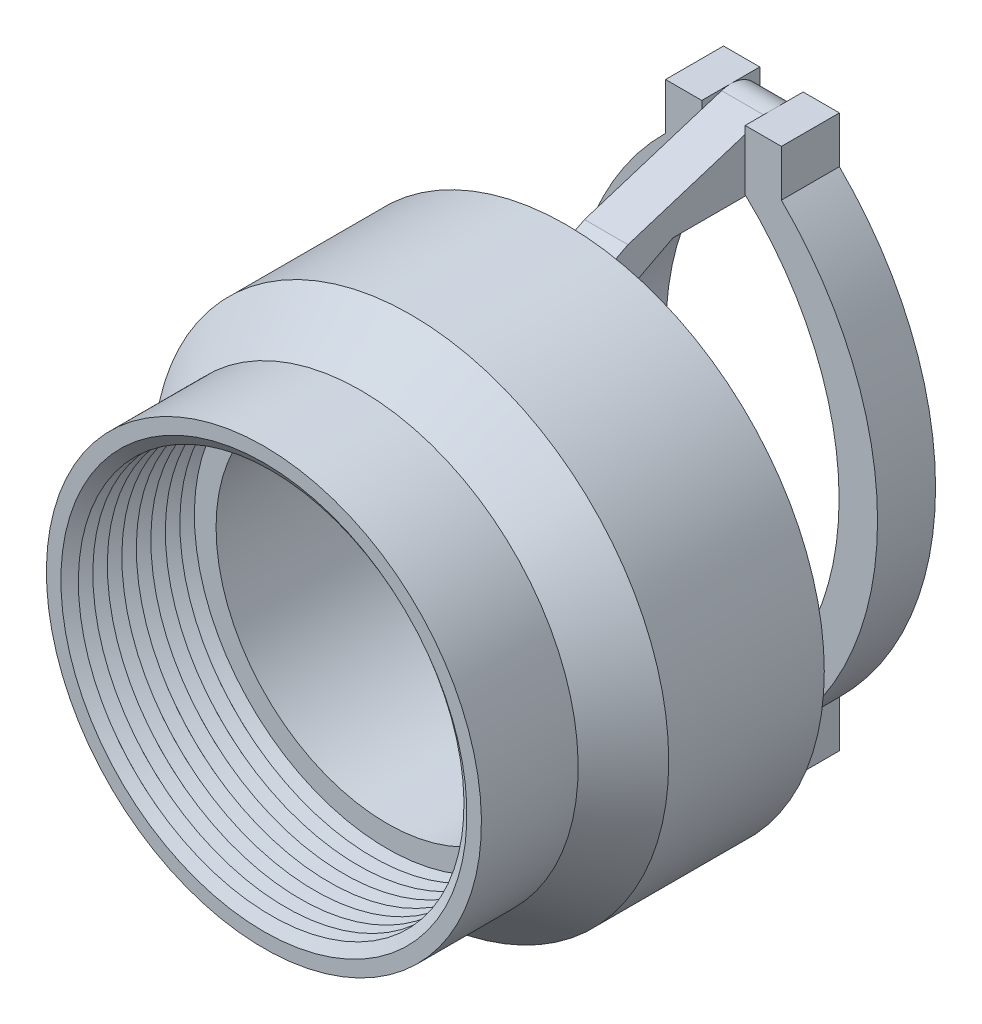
ISO-10303-21;
HEADER;
FILE_DESCRIPTION(('STEP AP214'),'2;1');
FILE_NAME('part.step','',(''),(''),'','','');
FILE_SCHEMA(('AUTOMOTIVE_DESIGN { 1 0 10303 214 1 1 1 1 }'));
ENDSEC;
DATA;
#1=APPLICATION_CONTEXT('core data for automotive mechanical design processes');
#2=APPLICATION_PROTOCOL_DEFINITION('international standard','automotive_design',2000,#1);
#3=PRODUCT_CONTEXT('',#1,'mechanical');
#4=PRODUCT('Part','Part','',(#3));
#5=PRODUCT_RELATED_PRODUCT_CATEGORY('part','',(#4));
#6=PRODUCT_DEFINITION_FORMATION('','',#4);
#7=PRODUCT_DEFINITION_CONTEXT('part definition',#1,'design');
#8=PRODUCT_DEFINITION('design','',#6,#7);
#9=PRODUCT_DEFINITION_SHAPE('','',#8);
#10=(LENGTH_UNIT() NAMED_UNIT(*) SI_UNIT(.MILLI.,.METRE.));
#11=(NAMED_UNIT(*) PLANE_ANGLE_UNIT() SI_UNIT($,.RADIAN.));
#12=(NAMED_UNIT(*) SI_UNIT($,.STERADIAN.) SOLID_ANGLE_UNIT());
#13=UNCERTAINTY_MEASURE_WITH_UNIT(LENGTH_MEASURE(1.E-05),#10,'distance_accuracy_value','');
#14=(GEOMETRIC_REPRESENTATION_CONTEXT(3) GLOBAL_UNCERTAINTY_ASSIGNED_CONTEXT((#13)) GLOBAL_UNIT_ASSIGNED_CONTEXT((#10,
#11,#12)) REPRESENTATION_CONTEXT('',''));
#15=CARTESIAN_POINT('',(0.,0.,0.));
#16=DIRECTION('',(0.,0.,1.));
#17=DIRECTION('',(1.,0.,0.));
#18=AXIS2_PLACEMENT_3D('',#15,#16,#17);
#19=CARTESIAN_POINT('',(1.5,16.94109859,-33.69109859));
#20=DIRECTION('',(-1.,0.,0.));
#21=DIRECTION('',(0.,0.,1.));
#22=AXIS2_PLACEMENT_3D('',#19,#20,#21);
#23=PLANE('',#22);
#24=DIRECTION('',(0.,1.,0.));
#25=VECTOR('',#24,1.);
#26=CARTESIAN_POINT('',(1.5,16.94109859,-35.69109859));
#27=LINE('',#26,#25);
#28=CARTESIAN_POINT('',(1.5,16.2721702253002,-35.69109859));
#29=VERTEX_POINT('',#28);
#30=CARTESIAN_POINT('',(1.5,17.6100269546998,-35.69109859));
#31=VERTEX_POINT('',#30);
#32=EDGE_CURVE('E423',#29,#31,#27,.T.);
#33=ORIENTED_EDGE('',*,*,#32,.F.);
#34=CARTESIAN_POINT('',(1.5,16.94109859,-33.69109859));
#35=DIRECTION('',(1.,0.,0.));
#36=DIRECTION('',(0.,0.,1.));
#37=AXIS2_PLACEMENT_3D('',#34,#35,#36);
#38=CIRCLE('',#37,2.10890141);
#39=EDGE_CURVE('E681',#29,#31,#38,.T.);
#40=ORIENTED_EDGE('',*,*,#39,.T.);
#41=EDGE_LOOP('',(#33,#40));
#42=FACE_BOUND('',#41,.T.);
#43=ADVANCED_FACE('F39',(#42),#23,.F.);
#44=CARTESIAN_POINT('',(1.5,-16.94109859,-33.69109859));
#45=DIRECTION('',(1.,0.,0.));
#46=DIRECTION('',(0.,0.,-1.));
#47=AXIS2_PLACEMENT_3D('',#44,#45,#46);
#48=PLANE('',#47);
#49=CARTESIAN_POINT('',(1.5,-16.94109859,-33.69109859));
#50=DIRECTION('',(1.,0.,0.));
#51=DIRECTION('',(0.,0.,-1.));
#52=AXIS2_PLACEMENT_3D('',#49,#50,#51);
#53=CIRCLE('',#52,2.10890141);
#54=CARTESIAN_POINT('',(1.5,-17.6100269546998,-35.69109859));
#55=VERTEX_POINT('',#54);
#56=CARTESIAN_POINT('',(1.5,-16.2721702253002,-35.69109859));
#57=VERTEX_POINT('',#56);
#58=EDGE_CURVE('E628',#55,#57,#53,.T.);
#59=ORIENTED_EDGE('',*,*,#58,.T.);
#60=DIRECTION('',(0.,-1.,0.));
#61=VECTOR('',#60,1.);
#62=CARTESIAN_POINT('',(1.5,-16.94109859,-35.69109859));
#63=LINE('',#62,#61);
#64=EDGE_CURVE('E812',#57,#55,#63,.T.);
#65=ORIENTED_EDGE('',*,*,#64,.T.);
#66=EDGE_LOOP('',(#59,#65));
#67=FACE_BOUND('',#66,.T.);
#68=ADVANCED_FACE('F478',(#67),#48,.T.);
#69=CARTESIAN_POINT('',(1.5,16.94109859,-33.69109859));
#70=DIRECTION('',(-1.,0.,0.));
#71=DIRECTION('',(0.,0.,1.));
#72=AXIS2_PLACEMENT_3D('',#69,#70,#71);
#73=CYLINDRICAL_SURFACE('',#72,2.10890141);
#74=DIRECTION('',(-1.,0.,0.));
#75=VECTOR('',#74,1.);
#76=CARTESIAN_POINT('',(1.5,18.9524500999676,-33.0571188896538));
#77=LINE('',#76,#75);
#78=CARTESIAN_POINT('',(1.49490347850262,18.9524500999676,-33.0571188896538));
#79=VERTEX_POINT('',#78);
#80=CARTESIAN_POINT('',(-1.49490347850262,18.9524500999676,-33.0571188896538));
#81=VERTEX_POINT('',#80);
#82=EDGE_CURVE('E708',#79,#81,#77,.T.);
#83=ORIENTED_EDGE('',*,*,#82,.F.);
#84=CARTESIAN_POINT('',(1.49490347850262,16.94109859,-33.69109859));
#85=DIRECTION('',(-1.,0.,0.));
#86=DIRECTION('',(0.,-1.,0.));
#87=AXIS2_PLACEMENT_3D('',#84,#85,#86);
#88=CIRCLE('',#87,2.10890141);
#89=CARTESIAN_POINT('',(1.49490347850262,19.05,-33.69109859));
#90=VERTEX_POINT('',#89);
#91=EDGE_CURVE('E54',#79,#90,#88,.T.);
#92=ORIENTED_EDGE('',*,*,#91,.T.);
#93=CARTESIAN_POINT('',(1.49490347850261,17.6100269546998,-35.69109859));
#94=VERTEX_POINT('',#93);
#95=EDGE_CURVE('E58',#90,#94,#88,.T.);
#96=ORIENTED_EDGE('',*,*,#95,.T.);
#97=DIRECTION('',(-1.,0.,0.));
#98=VECTOR('',#97,1.);
#99=CARTESIAN_POINT('',(1.5,17.6100269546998,-35.69109859));
#100=LINE('',#99,#98);
#101=EDGE_CURVE('E429',#31,#94,#100,.T.);
#102=ORIENTED_EDGE('',*,*,#101,.F.);
#103=ORIENTED_EDGE('',*,*,#39,.F.);
#104=DIRECTION('',(-1.,0.,0.));
#105=VECTOR('',#104,1.);
#106=CARTESIAN_POINT('',(1.5,16.2721702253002,-35.69109859));
#107=LINE('',#106,#105);
#108=CARTESIAN_POINT('',(1.49490347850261,16.2721702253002,-35.69109859));
#109=VERTEX_POINT('',#108);
#110=EDGE_CURVE('E426',#109,#29,#107,.F.);
#111=ORIENTED_EDGE('',*,*,#110,.F.);
#112=CARTESIAN_POINT('',(1.49490347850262,14.91292631,-34.2690106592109));
#113=VERTEX_POINT('',#112);
#114=EDGE_CURVE('E582',#109,#113,#88,.T.);
#115=ORIENTED_EDGE('',*,*,#114,.T.);
#116=CARTESIAN_POINT('',(1.49490347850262,14.91292631,-34.2690106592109));
#117=CARTESIAN_POINT('',(1.50677555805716,14.9018439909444,-34.2301393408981));
#118=CARTESIAN_POINT('',(1.51751165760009,14.8917969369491,-34.190616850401));
#119=CARTESIAN_POINT('',(1.5365888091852,14.8739132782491,-34.1104903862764));
#120=CARTESIAN_POINT('',(1.54492880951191,14.8660776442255,-34.0698859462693));
#121=CARTESIAN_POINT('',(1.5590756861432,14.8527708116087,-33.9878762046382));
#122=CARTESIAN_POINT('',(1.56488411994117,14.8472981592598,-33.9464714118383));
#123=CARTESIAN_POINT('',(1.57388784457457,14.8388090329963,-33.8631476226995));
#124=CARTESIAN_POINT('',(1.57708366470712,14.8357920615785,-33.8212287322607));
#125=CARTESIAN_POINT('',(1.58266909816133,14.8305203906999,-33.6948977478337));
#126=CARTESIAN_POINT('',(1.58102693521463,14.8320730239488,-33.6100826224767));
#127=CARTESIAN_POINT('',(1.56707212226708,14.8452375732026,-33.4422820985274));
#128=CARTESIAN_POINT('',(1.55477624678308,14.856833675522,-33.3592940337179));
#129=CARTESIAN_POINT('',(1.53161073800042,14.8785805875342,-33.2502909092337));
#130=CARTESIAN_POINT('',(1.52505201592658,14.8847312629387,-33.2224564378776));
#131=CARTESIAN_POINT('',(1.51081012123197,14.8980661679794,-33.1673787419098));
#132=CARTESIAN_POINT('',(1.50312880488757,14.905248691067,-33.140134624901));
#133=CARTESIAN_POINT('',(1.49490347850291,14.9129263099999,-33.113186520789));
#134=B_SPLINE_CURVE_WITH_KNOTS('',3,(#116,#117,#118,#119,#120,#121,#122,#123,#124,#125,#126,
#127,#128,#129,#130,#131,#132,#133),.UNSPECIFIED.,.F.,.F.,(4,2,2,2,2,2,2,2,4),(0.,
0.126362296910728,0.252779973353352,0.379119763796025,0.50543395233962,0.758583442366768,
1.01133506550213,1.0990541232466,1.18662973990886),.UNSPECIFIED.);
#135=CARTESIAN_POINT('',(1.5,14.9081675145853,-34.2520410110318));
#136=VERTEX_POINT('',#135);
#137=EDGE_CURVE('E464',#113,#136,#134,.T.);
#138=ORIENTED_EDGE('',*,*,#137,.T.);
#139=CARTESIAN_POINT('',(1.5,14.83219718,-33.69109859));
#140=VERTEX_POINT('',#139);
#141=EDGE_CURVE('E682',#140,#136,#38,.T.);
#142=ORIENTED_EDGE('',*,*,#141,.F.);
#143=DIRECTION('',(-1.,0.,0.));
#144=VECTOR('',#143,1.);
#145=CARTESIAN_POINT('',(1.5,14.83219718,-33.69109859));
#146=LINE('',#145,#144);
#147=CARTESIAN_POINT('',(-1.5,14.83219718,-33.69109859));
#148=VERTEX_POINT('',#147);
#149=EDGE_CURVE('E710',#140,#148,#146,.T.);
#150=ORIENTED_EDGE('',*,*,#149,.T.);
#151=CARTESIAN_POINT('',(-1.5,16.94109859,-33.69109859));
#152=DIRECTION('',(1.,0.,0.));
#153=DIRECTION('',(0.,0.,1.));
#154=AXIS2_PLACEMENT_3D('',#151,#152,#153);
#155=CIRCLE('',#154,2.10890141);
#156=CARTESIAN_POINT('',(-1.5,14.9081675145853,-34.2520410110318));
#157=VERTEX_POINT('',#156);
#158=EDGE_CURVE('E696',#148,#157,#155,.T.);
#159=ORIENTED_EDGE('',*,*,#158,.T.);
#160=CARTESIAN_POINT('',(-1.49490347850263,14.91292631,-34.2690106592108));
#161=CARTESIAN_POINT('',(-1.49576484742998,14.9121222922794,-34.2661890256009));
#162=CARTESIAN_POINT('',(-1.49662024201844,14.9113237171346,-34.2633640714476));
#163=CARTESIAN_POINT('',(-1.49831908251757,14.9097374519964,-34.2577075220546));
#164=CARTESIAN_POINT('',(-1.49916252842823,14.9089497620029,-34.2548759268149));
#165=CARTESIAN_POINT('',(-1.5,14.9081675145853,-34.2520410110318));
#166=B_SPLINE_CURVE_WITH_KNOTS('',3,(#160,#161,#162,#163,#164,#165),.UNSPECIFIED.,.F.,.F.,(4,2,
4),(0.,0.00917322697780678,0.0183464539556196),.UNSPECIFIED.);
#167=CARTESIAN_POINT('',(-1.49490347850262,14.91292631,-34.2690106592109));
#168=VERTEX_POINT('',#167);
#169=EDGE_CURVE('E484',#168,#157,#166,.T.);
#170=ORIENTED_EDGE('',*,*,#169,.F.);
#171=CARTESIAN_POINT('',(-1.49490347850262,16.94109859,-33.69109859));
#172=DIRECTION('',(-1.,0.,0.));
#173=DIRECTION('',(0.,-1.,0.));
#174=AXIS2_PLACEMENT_3D('',#171,#172,#173);
#175=CIRCLE('',#174,2.10890141);
#176=CARTESIAN_POINT('',(-1.49490347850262,16.2721702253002,-35.69109859));
#177=VERTEX_POINT('',#176);
#178=EDGE_CURVE('E646',#177,#168,#175,.T.);
#179=ORIENTED_EDGE('',*,*,#178,.F.);
#180=DIRECTION('',(-1.,0.,0.));
#181=VECTOR('',#180,1.);
#182=CARTESIAN_POINT('',(1.5,16.2721702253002,-35.69109859));
#183=LINE('',#182,#181);
#184=CARTESIAN_POINT('',(-1.5,16.2721702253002,-35.69109859));
#185=VERTEX_POINT('',#184);
#186=EDGE_CURVE('E523',#185,#177,#183,.F.);
#187=ORIENTED_EDGE('',*,*,#186,.F.);
#188=CARTESIAN_POINT('',(-1.5,17.6100269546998,-35.69109859));
#189=VERTEX_POINT('',#188);
#190=EDGE_CURVE('E695',#185,#189,#155,.T.);
#191=ORIENTED_EDGE('',*,*,#190,.T.);
#192=DIRECTION('',(-1.,0.,0.));
#193=VECTOR('',#192,1.);
#194=CARTESIAN_POINT('',(1.5,17.6100269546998,-35.69109859));
#195=LINE('',#194,#193);
#196=CARTESIAN_POINT('',(-1.49490347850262,17.6100269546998,-35.69109859));
#197=VERTEX_POINT('',#196);
#198=EDGE_CURVE('E521',#197,#189,#195,.T.);
#199=ORIENTED_EDGE('',*,*,#198,.F.);
#200=CARTESIAN_POINT('',(-1.49490347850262,19.05,-33.69109859));
#201=VERTEX_POINT('',#200);
#202=EDGE_CURVE('E1599',#201,#197,#175,.T.);
#203=ORIENTED_EDGE('',*,*,#202,.F.);
#204=EDGE_CURVE('E834',#81,#201,#175,.T.);
#205=ORIENTED_EDGE('',*,*,#204,.F.);
#206=EDGE_LOOP('',(#83,#92,#96,#102,#103,#111,#115,#138,#142,#150,#159,#170,#179,#187,#191,#199,
#203,#205));
#207=FACE_BOUND('',#206,.T.);
#208=ADVANCED_FACE('F472',(#207),#73,.T.);
#209=CARTESIAN_POINT('',(1.5,18.9524500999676,-33.0571188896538));
#210=DIRECTION('',(0.,-0.953743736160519,-0.300620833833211));
#211=DIRECTION('',(0.,0.300620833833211,-0.953743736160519));
#212=AXIS2_PLACEMENT_3D('',#209,#210,#211);
#213=PLANE('',#212);
#214=DIRECTION('',(-1.,0.,0.));
#215=VECTOR('',#214,1.);
#216=CARTESIAN_POINT('',(1.5,18.5218793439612,-31.69109859));
#217=LINE('',#216,#215);
#218=CARTESIAN_POINT('',(1.5,18.5218793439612,-31.69109859));
#219=VERTEX_POINT('',#218);
#220=CARTESIAN_POINT('',(1.49490347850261,18.5218793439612,-31.69109859));
#221=VERTEX_POINT('',#220);
#222=EDGE_CURVE('E436',#219,#221,#217,.T.);
#223=ORIENTED_EDGE('',*,*,#222,.T.);
#224=DIRECTION('',(0.,0.300620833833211,-0.953743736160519));
#225=VECTOR('',#224,1.);
#226=CARTESIAN_POINT('',(1.49490347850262,18.9524500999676,-33.0571188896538));
#227=LINE('',#226,#225);
#228=EDGE_CURVE('E11',#221,#79,#227,.T.);
#229=ORIENTED_EDGE('',*,*,#228,.T.);
#230=ORIENTED_EDGE('',*,*,#82,.T.);
#231=DIRECTION('',(0.,0.300620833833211,-0.953743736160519));
#232=VECTOR('',#231,1.);
#233=CARTESIAN_POINT('',(-1.49490347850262,18.9524500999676,-33.0571188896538));
#234=LINE('',#233,#232);
#235=CARTESIAN_POINT('',(-1.49490347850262,18.5218793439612,-31.69109859));
#236=VERTEX_POINT('',#235);
#237=EDGE_CURVE('E809',#236,#81,#234,.T.);
#238=ORIENTED_EDGE('',*,*,#237,.F.);
#239=DIRECTION('',(-1.,0.,0.));
#240=VECTOR('',#239,1.);
#241=CARTESIAN_POINT('',(1.5,18.5218793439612,-31.69109859));
#242=LINE('',#241,#240);
#243=CARTESIAN_POINT('',(-1.5,18.5218793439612,-31.69109859));
#244=VERTEX_POINT('',#243);
#245=EDGE_CURVE('E514',#236,#244,#242,.T.);
#246=ORIENTED_EDGE('',*,*,#245,.T.);
#247=DIRECTION('',(0.,-0.300620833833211,0.953743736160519));
#248=VECTOR('',#247,1.);
#249=CARTESIAN_POINT('',(-1.5,18.9524500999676,-33.0571188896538));
#250=LINE('',#249,#248);
#251=CARTESIAN_POINT('',(-1.5,15.9739907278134,-23.6077173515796));
#252=VERTEX_POINT('',#251);
#253=EDGE_CURVE('E699',#244,#252,#250,.T.);
#254=ORIENTED_EDGE('',*,*,#253,.T.);
#255=DIRECTION('',(-1.,0.,0.));
#256=VECTOR('',#255,1.);
#257=CARTESIAN_POINT('',(1.5,15.9739907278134,-23.6077173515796));
#258=LINE('',#257,#256);
#259=CARTESIAN_POINT('',(1.5,15.9739907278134,-23.6077173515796));
#260=VERTEX_POINT('',#259);
#261=EDGE_CURVE('E705',#260,#252,#258,.T.);
#262=ORIENTED_EDGE('',*,*,#261,.F.);
#263=DIRECTION('',(0.,-0.300620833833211,0.953743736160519));
#264=VECTOR('',#263,1.);
#265=CARTESIAN_POINT('',(1.5,18.9524500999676,-33.0571188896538));
#266=LINE('',#265,#264);
#267=EDGE_CURVE('E684',#219,#260,#266,.T.);
#268=ORIENTED_EDGE('',*,*,#267,.F.);
#269=EDGE_LOOP('',(#223,#229,#230,#238,#246,#254,#262,#268));
#270=FACE_BOUND('',#269,.T.);
#271=ADVANCED_FACE('F477',(#270),#213,.F.);
#272=CARTESIAN_POINT('',(-1.5,16.94109859,-33.69109859));
#273=DIRECTION('',(-1.,0.,0.));
#274=DIRECTION('',(0.,0.,1.));
#275=AXIS2_PLACEMENT_3D('',#272,#273,#274);
#276=PLANE('',#275);
#277=DIRECTION('',(0.,1.,0.));
#278=VECTOR('',#277,1.);
#279=CARTESIAN_POINT('',(-1.5,16.94109859,-31.69109859));
#280=LINE('',#279,#278);
#281=CARTESIAN_POINT('',(-1.5,14.9081675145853,-31.69109859));
#282=VERTEX_POINT('',#281);
#283=EDGE_CURVE('E517',#282,#244,#280,.T.);
#284=ORIENTED_EDGE('',*,*,#283,.F.);
#285=DIRECTION('',(0.,0.,-1.));
#286=VECTOR('',#285,1.);
#287=CARTESIAN_POINT('',(-1.5,14.9081675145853,-31.69109859));
#288=LINE('',#287,#286);
#289=EDGE_CURVE('E492',#282,#157,#288,.T.);
#290=ORIENTED_EDGE('',*,*,#289,.T.);
#291=ORIENTED_EDGE('',*,*,#158,.F.);
#292=DIRECTION('',(0.,0.,-1.));
#293=VECTOR('',#292,1.);
#294=CARTESIAN_POINT('',(-1.5,14.83219718,-26.714818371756));
#295=LINE('',#294,#293);
#296=CARTESIAN_POINT('',(-1.5,14.83219718,-26.714818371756));
#297=VERTEX_POINT('',#296);
#298=EDGE_CURVE('E693',#297,#148,#295,.T.);
#299=ORIENTED_EDGE('',*,*,#298,.F.);
#300=DIRECTION('',(0.,0.460180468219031,-0.887825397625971));
#301=VECTOR('',#300,1.);
#302=CARTESIAN_POINT('',(-1.5,11.8,-20.86480549));
#303=LINE('',#302,#301);
#304=CARTESIAN_POINT('',(-1.5,11.8,-20.86480549));
#305=VERTEX_POINT('',#304);
#306=EDGE_CURVE('E691',#305,#297,#303,.T.);
#307=ORIENTED_EDGE('',*,*,#306,.F.);
#308=DIRECTION('',(0.,-1.,0.));
#309=VECTOR('',#308,1.);
#310=CARTESIAN_POINT('',(-1.5,14.5522759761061,-20.86480549));
#311=LINE('',#310,#309);
#312=CARTESIAN_POINT('',(-1.5,14.5522759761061,-20.86480549));
#313=VERTEX_POINT('',#312);
#314=EDGE_CURVE('E672',#313,#305,#311,.T.);
#315=ORIENTED_EDGE('',*,*,#314,.F.);
#316=DIRECTION('',(0.,-0.460180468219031,0.887825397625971));
#317=VECTOR('',#316,1.);
#318=CARTESIAN_POINT('',(-1.5,15.9739907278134,-23.6077173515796));
#319=LINE('',#318,#317);
#320=EDGE_CURVE('E677',#252,#313,#319,.T.);
#321=ORIENTED_EDGE('',*,*,#320,.F.);
#322=ORIENTED_EDGE('',*,*,#253,.F.);
#323=EDGE_LOOP('',(#284,#290,#291,#299,#307,#315,#321,#322));
#324=FACE_BOUND('',#323,.T.);
#325=ADVANCED_FACE('F929',(#324),#276,.T.);
#326=ORIENTED_EDGE('',*,*,#190,.F.);
#327=DIRECTION('',(0.,1.,0.));
#328=VECTOR('',#327,1.);
#329=CARTESIAN_POINT('',(-1.5,16.94109859,-35.69109859));
#330=LINE('',#329,#328);
#331=EDGE_CURVE('E525',#185,#189,#330,.T.);
#332=ORIENTED_EDGE('',*,*,#331,.T.);
#333=EDGE_LOOP('',(#326,#332));
#334=FACE_BOUND('',#333,.T.);
#335=ADVANCED_FACE('F1448',(#334),#276,.T.);
#336=CARTESIAN_POINT('',(1.5,-18.9524500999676,-33.0571188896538));
#337=DIRECTION('',(0.,0.953743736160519,-0.300620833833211));
#338=DIRECTION('',(0.,0.300620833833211,0.953743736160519));
#339=AXIS2_PLACEMENT_3D('',#336,#337,#338);
#340=PLANE('',#339);
#341=DIRECTION('',(-1.,0.,0.));
#342=VECTOR('',#341,1.);
#343=CARTESIAN_POINT('',(1.5,-18.9524500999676,-33.0571188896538));
#344=LINE('',#343,#342);
#345=CARTESIAN_POINT('',(1.49490347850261,-18.9524500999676,-33.0571188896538));
#346=VERTEX_POINT('',#345);
#347=CARTESIAN_POINT('',(-1.49490347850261,-18.9524500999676,-33.0571188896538));
#348=VERTEX_POINT('',#347);
#349=EDGE_CURVE('E665',#346,#348,#344,.T.);
#350=ORIENTED_EDGE('',*,*,#349,.F.);
#351=DIRECTION('',(0.,0.300620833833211,0.953743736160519));
#352=VECTOR('',#351,1.);
#353=CARTESIAN_POINT('',(1.49490347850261,-18.9524500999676,-33.0571188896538));
#354=LINE('',#353,#352);
#355=CARTESIAN_POINT('',(1.49490347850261,-18.5218793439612,-31.69109859));
#356=VERTEX_POINT('',#355);
#357=EDGE_CURVE('E470',#346,#356,#354,.T.);
#358=ORIENTED_EDGE('',*,*,#357,.T.);
#359=DIRECTION('',(1.,0.,0.));
#360=VECTOR('',#359,1.);
#361=CARTESIAN_POINT('',(1.5,-18.5218793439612,-31.69109859));
#362=LINE('',#361,#360);
#363=CARTESIAN_POINT('',(1.5,-18.5218793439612,-31.69109859));
#364=VERTEX_POINT('',#363);
#365=EDGE_CURVE('E431',#356,#364,#362,.T.);
#366=ORIENTED_EDGE('',*,*,#365,.T.);
#367=DIRECTION('',(0.,-0.300620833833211,-0.953743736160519));
#368=VECTOR('',#367,1.);
#369=CARTESIAN_POINT('',(1.5,-18.9524500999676,-33.0571188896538));
#370=LINE('',#369,#368);
#371=CARTESIAN_POINT('',(1.5,-15.9739907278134,-23.6077173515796));
#372=VERTEX_POINT('',#371);
#373=EDGE_CURVE('E629',#372,#364,#370,.T.);
#374=ORIENTED_EDGE('',*,*,#373,.F.);
#375=DIRECTION('',(-1.,0.,0.));
#376=VECTOR('',#375,1.);
#377=CARTESIAN_POINT('',(1.5,-15.9739907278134,-23.6077173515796));
#378=LINE('',#377,#376);
#379=CARTESIAN_POINT('',(-1.5,-15.9739907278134,-23.6077173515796));
#380=VERTEX_POINT('',#379);
#381=EDGE_CURVE('E667',#372,#380,#378,.T.);
#382=ORIENTED_EDGE('',*,*,#381,.T.);
#383=DIRECTION('',(0.,-0.300620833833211,-0.953743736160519));
#384=VECTOR('',#383,1.);
#385=CARTESIAN_POINT('',(-1.5,-18.9524500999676,-33.0571188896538));
#386=LINE('',#385,#384);
#387=CARTESIAN_POINT('',(-1.5,-18.5218793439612,-31.69109859));
#388=VERTEX_POINT('',#387);
#389=EDGE_CURVE('E648',#380,#388,#386,.T.);
#390=ORIENTED_EDGE('',*,*,#389,.T.);
#391=DIRECTION('',(1.,0.,0.));
#392=VECTOR('',#391,1.);
#393=CARTESIAN_POINT('',(1.5,-18.5218793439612,-31.69109859));
#394=LINE('',#393,#392);
#395=CARTESIAN_POINT('',(-1.49490347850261,-18.5218793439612,-31.69109859));
#396=VERTEX_POINT('',#395);
#397=EDGE_CURVE('E519',#388,#396,#394,.T.);
#398=ORIENTED_EDGE('',*,*,#397,.T.);
#399=DIRECTION('',(0.,0.300620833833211,0.953743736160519));
#400=VECTOR('',#399,1.);
#401=CARTESIAN_POINT('',(-1.49490347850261,-18.9524500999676,-33.0571188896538));
#402=LINE('',#401,#400);
#403=EDGE_CURVE('E491',#348,#396,#402,.T.);
#404=ORIENTED_EDGE('',*,*,#403,.F.);
#405=EDGE_LOOP('',(#350,#358,#366,#374,#382,#390,#398,#404));
#406=FACE_BOUND('',#405,.T.);
#407=ADVANCED_FACE('F828',(#406),#340,.F.);
#408=CARTESIAN_POINT('',(1.5,-16.94109859,-33.69109859));
#409=DIRECTION('',(-1.,0.,0.));
#410=DIRECTION('',(0.,0.,1.));
#411=AXIS2_PLACEMENT_3D('',#408,#409,#410);
#412=CYLINDRICAL_SURFACE('',#411,2.10890141);
#413=CARTESIAN_POINT('',(1.5,-14.9081675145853,-34.2520410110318));
#414=VERTEX_POINT('',#413);
#415=CARTESIAN_POINT('',(1.5,-14.83219718,-33.69109859));
#416=VERTEX_POINT('',#415);
#417=EDGE_CURVE('E623',#414,#416,#53,.T.);
#418=ORIENTED_EDGE('',*,*,#417,.F.);
#419=CARTESIAN_POINT('',(1.49490347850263,-14.91292631,-33.1131865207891));
#420=CARTESIAN_POINT('',(1.50677555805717,-14.9018439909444,-33.1520578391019));
#421=CARTESIAN_POINT('',(1.5175116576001,-14.8917969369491,-33.191580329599));
#422=CARTESIAN_POINT('',(1.5365888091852,-14.8739132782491,-33.2717067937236));
#423=CARTESIAN_POINT('',(1.54492880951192,-14.8660776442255,-33.3123112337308));
#424=CARTESIAN_POINT('',(1.55907568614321,-14.8527708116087,-33.3943209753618));
#425=CARTESIAN_POINT('',(1.56488411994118,-14.8472981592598,-33.4357257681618));
#426=CARTESIAN_POINT('',(1.57388784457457,-14.8388090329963,-33.5190495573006));
#427=CARTESIAN_POINT('',(1.57708366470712,-14.8357920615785,-33.5609684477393));
#428=CARTESIAN_POINT('',(1.58266909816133,-14.8305203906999,-33.6872994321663));
#429=CARTESIAN_POINT('',(1.58102693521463,-14.8320730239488,-33.7721145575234));
#430=CARTESIAN_POINT('',(1.56707212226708,-14.8452375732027,-33.9399150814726));
#431=CARTESIAN_POINT('',(1.55477624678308,-14.856833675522,-34.0229031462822));
#432=CARTESIAN_POINT('',(1.53161073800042,-14.8785805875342,-34.1319062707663));
#433=CARTESIAN_POINT('',(1.52505201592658,-14.8847312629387,-34.1597407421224));
#434=CARTESIAN_POINT('',(1.51081012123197,-14.8980661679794,-34.2148184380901));
#435=CARTESIAN_POINT('',(1.50312880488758,-14.905248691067,-34.242062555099));
#436=CARTESIAN_POINT('',(1.49490347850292,-14.9129263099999,-34.2690106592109));
#437=B_SPLINE_CURVE_WITH_KNOTS('',3,(#419,#420,#421,#422,#423,#424,#425,#426,#427,#428,#429,
#430,#431,#432,#433,#434,#435,#436),.UNSPECIFIED.,.F.,.F.,(4,2,2,2,2,2,2,2,4),(0.,
0.126362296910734,0.252779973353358,0.379119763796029,0.505433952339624,0.758583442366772,
1.01133506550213,1.09905412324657,1.1866297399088),.UNSPECIFIED.);
#438=CARTESIAN_POINT('',(1.49490347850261,-14.91292631,-34.2690106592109));
#439=VERTEX_POINT('',#438);
#440=EDGE_CURVE('E438',#414,#439,#437,.T.);
#441=ORIENTED_EDGE('',*,*,#440,.T.);
#442=CARTESIAN_POINT('',(1.49490347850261,-16.94109859,-33.69109859));
#443=DIRECTION('',(-1.,0.,0.));
#444=DIRECTION('',(0.,-1.,0.));
#445=AXIS2_PLACEMENT_3D('',#442,#443,#444);
#446=CIRCLE('',#445,2.10890141);
#447=CARTESIAN_POINT('',(1.49490347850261,-16.2721702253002,-35.69109859));
#448=VERTEX_POINT('',#447);
#449=EDGE_CURVE('E47',#439,#448,#446,.T.);
#450=ORIENTED_EDGE('',*,*,#449,.T.);
#451=DIRECTION('',(-1.,0.,0.));
#452=VECTOR('',#451,1.);
#453=CARTESIAN_POINT('',(1.5,-16.2721702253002,-35.69109859));
#454=LINE('',#453,#452);
#455=EDGE_CURVE('E421',#57,#448,#454,.T.);
#456=ORIENTED_EDGE('',*,*,#455,.F.);
#457=ORIENTED_EDGE('',*,*,#58,.F.);
#458=DIRECTION('',(-1.,0.,0.));
#459=VECTOR('',#458,1.);
#460=CARTESIAN_POINT('',(1.5,-17.6100269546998,-35.69109859));
#461=LINE('',#460,#459);
#462=CARTESIAN_POINT('',(1.49490347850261,-17.6100269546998,-35.69109859));
#463=VERTEX_POINT('',#462);
#464=EDGE_CURVE('E355',#463,#55,#461,.F.);
#465=ORIENTED_EDGE('',*,*,#464,.F.);
#466=CARTESIAN_POINT('',(1.49490347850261,-19.05,-33.69109859));
#467=VERTEX_POINT('',#466);
#468=EDGE_CURVE('E818',#463,#467,#446,.T.);
#469=ORIENTED_EDGE('',*,*,#468,.T.);
#470=EDGE_CURVE('E820',#467,#346,#446,.T.);
#471=ORIENTED_EDGE('',*,*,#470,.T.);
#472=ORIENTED_EDGE('',*,*,#349,.T.);
#473=CARTESIAN_POINT('',(-1.49490347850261,-16.94109859,-33.69109859));
#474=DIRECTION('',(-1.,0.,0.));
#475=DIRECTION('',(0.,-1.,0.));
#476=AXIS2_PLACEMENT_3D('',#473,#474,#475);
#477=CIRCLE('',#476,2.10890141);
#478=CARTESIAN_POINT('',(-1.49490347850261,-19.05,-33.69109859));
#479=VERTEX_POINT('',#478);
#480=EDGE_CURVE('E807',#479,#348,#477,.T.);
#481=ORIENTED_EDGE('',*,*,#480,.F.);
#482=CARTESIAN_POINT('',(-1.49490347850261,-17.6100269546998,-35.69109859));
#483=VERTEX_POINT('',#482);
#484=EDGE_CURVE('E804',#483,#479,#477,.T.);
#485=ORIENTED_EDGE('',*,*,#484,.F.);
#486=DIRECTION('',(-1.,0.,0.));
#487=VECTOR('',#486,1.);
#488=CARTESIAN_POINT('',(1.5,-17.6100269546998,-35.69109859));
#489=LINE('',#488,#487);
#490=CARTESIAN_POINT('',(-1.5,-17.6100269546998,-35.69109859));
#491=VERTEX_POINT('',#490);
#492=EDGE_CURVE('E531',#491,#483,#489,.F.);
#493=ORIENTED_EDGE('',*,*,#492,.F.);
#494=CARTESIAN_POINT('',(-1.5,-16.94109859,-33.69109859));
#495=DIRECTION('',(1.,0.,0.));
#496=DIRECTION('',(0.,0.,-1.));
#497=AXIS2_PLACEMENT_3D('',#494,#495,#496);
#498=CIRCLE('',#497,2.10890141);
#499=CARTESIAN_POINT('',(-1.5,-16.2721702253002,-35.69109859));
#500=VERTEX_POINT('',#499);
#501=EDGE_CURVE('E653',#491,#500,#498,.T.);
#502=ORIENTED_EDGE('',*,*,#501,.T.);
#503=DIRECTION('',(-1.,0.,0.));
#504=VECTOR('',#503,1.);
#505=CARTESIAN_POINT('',(1.5,-16.2721702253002,-35.69109859));
#506=LINE('',#505,#504);
#507=CARTESIAN_POINT('',(-1.49490347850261,-16.2721702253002,-35.69109859));
#508=VERTEX_POINT('',#507);
#509=EDGE_CURVE('E528',#508,#500,#506,.T.);
#510=ORIENTED_EDGE('',*,*,#509,.F.);
#511=CARTESIAN_POINT('',(-1.49490347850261,-14.91292631,-34.2690106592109));
#512=VERTEX_POINT('',#511);
#513=EDGE_CURVE('E808',#512,#508,#477,.T.);
#514=ORIENTED_EDGE('',*,*,#513,.F.);
#515=CARTESIAN_POINT('',(-1.5,-14.9081675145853,-34.2520410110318));
#516=CARTESIAN_POINT('',(-1.49916252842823,-14.9089497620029,-34.2548759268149));
#517=CARTESIAN_POINT('',(-1.49831908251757,-14.9097374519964,-34.2577075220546));
#518=CARTESIAN_POINT('',(-1.49662024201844,-14.9113237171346,-34.2633640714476));
#519=CARTESIAN_POINT('',(-1.49576484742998,-14.9121222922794,-34.2661890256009));
#520=CARTESIAN_POINT('',(-1.49490347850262,-14.91292631,-34.2690106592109));
#521=B_SPLINE_CURVE_WITH_KNOTS('',3,(#515,#516,#517,#518,#519,#520),.UNSPECIFIED.,.F.,.F.,(4,2,
4),(0.,0.00917322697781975,0.0183464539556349),.UNSPECIFIED.);
#522=CARTESIAN_POINT('',(-1.5,-14.9081675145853,-34.2520410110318));
#523=VERTEX_POINT('',#522);
#524=EDGE_CURVE('E508',#523,#512,#521,.T.);
#525=ORIENTED_EDGE('',*,*,#524,.F.);
#526=CARTESIAN_POINT('',(-1.5,-14.83219718,-33.69109859));
#527=VERTEX_POINT('',#526);
#528=EDGE_CURVE('E651',#523,#527,#498,.T.);
#529=ORIENTED_EDGE('',*,*,#528,.T.);
#530=DIRECTION('',(-1.,0.,0.));
#531=VECTOR('',#530,1.);
#532=CARTESIAN_POINT('',(1.5,-14.83219718,-33.69109859));
#533=LINE('',#532,#531);
#534=EDGE_CURVE('E625',#416,#527,#533,.T.);
#535=ORIENTED_EDGE('',*,*,#534,.F.);
#536=EDGE_LOOP('',(#418,#441,#450,#456,#457,#465,#469,#471,#472,#481,#485,#493,#502,#510,#514,
#525,#529,#535));
#537=FACE_BOUND('',#536,.T.);
#538=ADVANCED_FACE('F448',(#537),#412,.T.);
#539=CARTESIAN_POINT('',(-1.5,-16.94109859,-33.69109859));
#540=DIRECTION('',(1.,0.,0.));
#541=DIRECTION('',(0.,0.,-1.));
#542=AXIS2_PLACEMENT_3D('',#539,#540,#541);
#543=PLANE('',#542);
#544=DIRECTION('',(0.,0.,-1.));
#545=VECTOR('',#544,1.);
#546=CARTESIAN_POINT('',(-1.5,-14.9081675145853,-31.69109859));
#547=LINE('',#546,#545);
#548=CARTESIAN_POINT('',(-1.5,-14.9081675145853,-31.69109859));
#549=VERTEX_POINT('',#548);
#550=EDGE_CURVE('E801',#549,#523,#547,.T.);
#551=ORIENTED_EDGE('',*,*,#550,.F.);
#552=DIRECTION('',(0.,-1.,0.));
#553=VECTOR('',#552,1.);
#554=CARTESIAN_POINT('',(-1.5,-16.94109859,-31.69109859));
#555=LINE('',#554,#553);
#556=EDGE_CURVE('E799',#549,#388,#555,.T.);
#557=ORIENTED_EDGE('',*,*,#556,.T.);
#558=ORIENTED_EDGE('',*,*,#389,.F.);
#559=DIRECTION('',(0.,-0.460180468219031,-0.887825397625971));
#560=VECTOR('',#559,1.);
#561=CARTESIAN_POINT('',(-1.5,-15.9739907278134,-23.6077173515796));
#562=LINE('',#561,#560);
#563=CARTESIAN_POINT('',(-1.5,-14.5522759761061,-20.86480549));
#564=VERTEX_POINT('',#563);
#565=EDGE_CURVE('E645',#564,#380,#562,.T.);
#566=ORIENTED_EDGE('',*,*,#565,.F.);
#567=DIRECTION('',(0.,-1.,0.));
#568=VECTOR('',#567,1.);
#569=CARTESIAN_POINT('',(-1.5,-14.5522759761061,-20.86480549));
#570=LINE('',#569,#568);
#571=CARTESIAN_POINT('',(-1.5,-11.8,-20.86480549));
#572=VERTEX_POINT('',#571);
#573=EDGE_CURVE('E642',#572,#564,#570,.T.);
#574=ORIENTED_EDGE('',*,*,#573,.F.);
#575=DIRECTION('',(0.,0.460180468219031,0.887825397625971));
#576=VECTOR('',#575,1.);
#577=CARTESIAN_POINT('',(-1.5,-11.8,-20.86480549));
#578=LINE('',#577,#576);
#579=CARTESIAN_POINT('',(-1.5,-14.83219718,-26.714818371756));
#580=VERTEX_POINT('',#579);
#581=EDGE_CURVE('E656',#580,#572,#578,.T.);
#582=ORIENTED_EDGE('',*,*,#581,.F.);
#583=DIRECTION('',(0.,0.,1.));
#584=VECTOR('',#583,1.);
#585=CARTESIAN_POINT('',(-1.5,-14.83219718,-26.714818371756));
#586=LINE('',#585,#584);
#587=EDGE_CURVE('E654',#527,#580,#586,.T.);
#588=ORIENTED_EDGE('',*,*,#587,.F.);
#589=ORIENTED_EDGE('',*,*,#528,.F.);
#590=EDGE_LOOP('',(#551,#557,#558,#566,#574,#582,#588,#589));
#591=FACE_BOUND('',#590,.T.);
#592=ADVANCED_FACE('F853',(#591),#543,.F.);
#593=DIRECTION('',(0.,-1.,0.));
#594=VECTOR('',#593,1.);
#595=CARTESIAN_POINT('',(-1.5,-16.94109859,-35.69109859));
#596=LINE('',#595,#594);
#597=EDGE_CURVE('E796',#500,#491,#596,.T.);
#598=ORIENTED_EDGE('',*,*,#597,.F.);
#599=ORIENTED_EDGE('',*,*,#501,.F.);
#600=EDGE_LOOP('',(#598,#599));
#601=FACE_BOUND('',#600,.T.);
#602=ADVANCED_FACE('F891',(#601),#543,.F.);
#603=CARTESIAN_POINT('',(0.,0.,0.));
#604=DIRECTION('',(0.,0.,-1.));
#605=DIRECTION('',(0.,1.,0.));
#606=AXIS2_PLACEMENT_3D('',#603,#604,#605);
#607=CYLINDRICAL_SURFACE('',#606,11.8);
#608=CARTESIAN_POINT('',(0.,0.,-8.49999999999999));
#609=DIRECTION('',(0.,0.,-1.));
#610=DIRECTION('',(0.,1.,0.));
#611=AXIS2_PLACEMENT_3D('',#608,#609,#610);
#612=CIRCLE('',#611,11.8);
#613=CARTESIAN_POINT('',(0.,11.8,-8.49999999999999));
#614=VERTEX_POINT('',#613);
#615=EDGE_CURVE('E774',#614,#614,#612,.T.);
#616=ORIENTED_EDGE('',*,*,#615,.F.);
#617=EDGE_LOOP('',(#616));
#618=FACE_BOUND('',#617,.T.);
#619=CARTESIAN_POINT('',(0.,0.,-20.86480549));
#620=DIRECTION('',(0.,0.,-1.));
#621=DIRECTION('',(0.,1.,0.));
#622=AXIS2_PLACEMENT_3D('',#619,#620,#621);
#623=CIRCLE('',#622,11.8);
#624=CARTESIAN_POINT('',(0.,11.8,-20.86480549));
#625=VERTEX_POINT('',#624);
#626=CARTESIAN_POINT('',(0.,-11.8,-20.86480549));
#627=VERTEX_POINT('',#626);
#628=EDGE_CURVE('E775',#625,#627,#623,.T.);
#629=ORIENTED_EDGE('',*,*,#628,.T.);
#630=EDGE_CURVE('E779',#627,#625,#623,.T.);
#631=ORIENTED_EDGE('',*,*,#630,.T.);
#632=EDGE_LOOP('',(#629,#631));
#633=FACE_BOUND('',#632,.T.);
#634=ADVANCED_FACE('F41',(#618,#633),#607,.F.);
#635=CARTESIAN_POINT('',(0.,11.8,0.));
#636=DIRECTION('',(0.,0.,1.));
#637=DIRECTION('',(0.,-1.,0.));
#638=AXIS2_PLACEMENT_3D('',#635,#636,#637);
#639=PLANE('',#638);
#640=CARTESIAN_POINT('',(0.,0.,0.));
#641=DIRECTION('',(0.,0.,-1.));
#642=DIRECTION('',(0.,1.,0.));
#643=AXIS2_PLACEMENT_3D('',#640,#641,#642);
#644=CIRCLE('',#643,14.0005);
#645=CARTESIAN_POINT('',(0.,14.0005,0.));
#646=VERTEX_POINT('',#645);
#647=EDGE_CURVE('E719',#646,#646,#644,.T.);
#648=ORIENTED_EDGE('',*,*,#647,.T.);
#649=EDGE_LOOP('',(#648));
#650=FACE_BOUND('',#649,.T.);
#651=CARTESIAN_POINT('',(0.,0.,0.));
#652=DIRECTION('',(0.,0.,-1.));
#653=DIRECTION('',(0.,1.,0.));
#654=AXIS2_PLACEMENT_3D('',#651,#652,#653);
#655=CIRCLE('',#654,15.);
#656=CARTESIAN_POINT('',(0.,15.,0.));
#657=VERTEX_POINT('',#656);
#658=EDGE_CURVE('E788',#657,#657,#655,.T.);
#659=ORIENTED_EDGE('',*,*,#658,.F.);
#660=EDGE_LOOP('',(#659));
#661=FACE_BOUND('',#660,.T.);
#662=ADVANCED_FACE('F898',(#650,#661),#639,.T.);
#663=CARTESIAN_POINT('',(0.,0.,0.));
#664=DIRECTION('',(0.,0.,-1.));
#665=DIRECTION('',(0.,1.,0.));
#666=AXIS2_PLACEMENT_3D('',#663,#664,#665);
#667=CYLINDRICAL_SURFACE('',#666,15.);
#668=ORIENTED_EDGE('',*,*,#658,.T.);
#669=EDGE_LOOP('',(#668));
#670=FACE_BOUND('',#669,.T.);
#671=CARTESIAN_POINT('',(0.,0.,-6.66998889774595));
#672=DIRECTION('',(0.,0.,-1.));
#673=DIRECTION('',(0.,1.,0.));
#674=AXIS2_PLACEMENT_3D('',#671,#672,#673);
#675=CIRCLE('',#674,15.);
#676=CARTESIAN_POINT('',(0.,15.,-6.66998889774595));
#677=VERTEX_POINT('',#676);
#678=EDGE_CURVE('E785',#677,#677,#675,.T.);
#679=ORIENTED_EDGE('',*,*,#678,.F.);
#680=EDGE_LOOP('',(#679));
#681=FACE_BOUND('',#680,.T.);
#682=ADVANCED_FACE('F1242',(#670,#681),#667,.T.);
#683=CARTESIAN_POINT('',(0.,0.,-10.1378275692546));
#684=DIRECTION('',(0.,0.,-1.));
#685=DIRECTION('',(0.,1.,0.));
#686=AXIS2_PLACEMENT_3D('',#683,#684,#685);
#687=CONICAL_SURFACE('',#686,17.78,0.675747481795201);
#688=ORIENTED_EDGE('',*,*,#678,.T.);
#689=EDGE_LOOP('',(#688));
#690=FACE_BOUND('',#689,.T.);
#691=CARTESIAN_POINT('',(0.,0.,-10.1378275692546));
#692=DIRECTION('',(0.,0.,-1.));
#693=DIRECTION('',(0.,1.,0.));
#694=AXIS2_PLACEMENT_3D('',#691,#692,#693);
#695=CIRCLE('',#694,17.78);
#696=CARTESIAN_POINT('',(0.,17.78,-10.1378275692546));
#697=VERTEX_POINT('',#696);
#698=EDGE_CURVE('E782',#697,#697,#695,.T.);
#699=ORIENTED_EDGE('',*,*,#698,.F.);
#700=EDGE_LOOP('',(#699));
#701=FACE_BOUND('',#700,.T.);
#702=ADVANCED_FACE('F1253',(#690,#701),#687,.T.);
#703=CARTESIAN_POINT('',(0.,0.,0.));
#704=DIRECTION('',(0.,0.,-1.));
#705=DIRECTION('',(0.,1.,0.));
#706=AXIS2_PLACEMENT_3D('',#703,#704,#705);
#707=CYLINDRICAL_SURFACE('',#706,17.78);
#708=ORIENTED_EDGE('',*,*,#698,.T.);
#709=EDGE_LOOP('',(#708));
#710=FACE_BOUND('',#709,.T.);
#711=CARTESIAN_POINT('',(0.,0.,-20.86480549));
#712=DIRECTION('',(0.,0.,-1.));
#713=DIRECTION('',(0.,1.,0.));
#714=AXIS2_PLACEMENT_3D('',#711,#712,#713);
#715=CIRCLE('',#714,17.78);
#716=CARTESIAN_POINT('',(0.,17.78,-20.86480549));
#717=VERTEX_POINT('',#716);
#718=EDGE_CURVE('E778',#717,#717,#715,.T.);
#719=ORIENTED_EDGE('',*,*,#718,.F.);
#720=EDGE_LOOP('',(#719));
#721=FACE_BOUND('',#720,.T.);
#722=ADVANCED_FACE('F1048',(#710,#721),#707,.T.);
#723=CARTESIAN_POINT('',(0.,17.78,-20.86480549));
#724=DIRECTION('',(0.,0.,-1.));
#725=DIRECTION('',(0.,1.,0.));
#726=AXIS2_PLACEMENT_3D('',#723,#724,#725);
#727=PLANE('',#726);
#728=DIRECTION('',(0.,-1.,0.));
#729=VECTOR('',#728,1.);
#730=CARTESIAN_POINT('',(1.5,-14.5522759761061,-20.86480549));
#731=LINE('',#730,#729);
#732=CARTESIAN_POINT('',(1.5,-11.8,-20.86480549));
#733=VERTEX_POINT('',#732);
#734=CARTESIAN_POINT('',(1.5,-14.5522759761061,-20.86480549));
#735=VERTEX_POINT('',#734);
#736=EDGE_CURVE('E658',#733,#735,#731,.T.);
#737=ORIENTED_EDGE('',*,*,#736,.F.);
#738=DIRECTION('',(-1.,0.,0.));
#739=VECTOR('',#738,1.);
#740=CARTESIAN_POINT('',(1.5,-11.8,-20.86480549));
#741=LINE('',#740,#739);
#742=EDGE_CURVE('E641',#733,#627,#741,.T.);
#743=ORIENTED_EDGE('',*,*,#742,.T.);
#744=ORIENTED_EDGE('',*,*,#628,.F.);
#745=DIRECTION('',(-1.,0.,0.));
#746=VECTOR('',#745,1.);
#747=CARTESIAN_POINT('',(1.5,11.8,-20.86480549));
#748=LINE('',#747,#746);
#749=CARTESIAN_POINT('',(1.5,11.8,-20.86480549));
#750=VERTEX_POINT('',#749);
#751=EDGE_CURVE('E716',#750,#625,#748,.T.);
#752=ORIENTED_EDGE('',*,*,#751,.F.);
#753=DIRECTION('',(0.,-1.,0.));
#754=VECTOR('',#753,1.);
#755=CARTESIAN_POINT('',(1.5,14.5522759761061,-20.86480549));
#756=LINE('',#755,#754);
#757=CARTESIAN_POINT('',(1.5,14.5522759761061,-20.86480549));
#758=VERTEX_POINT('',#757);
#759=EDGE_CURVE('E673',#758,#750,#756,.T.);
#760=ORIENTED_EDGE('',*,*,#759,.F.);
#761=DIRECTION('',(-1.,0.,0.));
#762=VECTOR('',#761,1.);
#763=CARTESIAN_POINT('',(1.5,14.5522759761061,-20.86480549));
#764=LINE('',#763,#762);
#765=EDGE_CURVE('E688',#758,#313,#764,.T.);
#766=ORIENTED_EDGE('',*,*,#765,.T.);
#767=ORIENTED_EDGE('',*,*,#314,.T.);
#768=EDGE_CURVE('E720',#625,#305,#748,.T.);
#769=ORIENTED_EDGE('',*,*,#768,.F.);
#770=ORIENTED_EDGE('',*,*,#630,.F.);
#771=DIRECTION('',(-1.,0.,0.));
#772=VECTOR('',#771,1.);
#773=CARTESIAN_POINT('',(0.,-11.8,-20.86480549));
#774=LINE('',#773,#772);
#775=EDGE_CURVE('E793',#627,#572,#774,.T.);
#776=ORIENTED_EDGE('',*,*,#775,.T.);
#777=ORIENTED_EDGE('',*,*,#573,.T.);
#778=DIRECTION('',(-1.,0.,0.));
#779=VECTOR('',#778,1.);
#780=CARTESIAN_POINT('',(1.5,-14.5522759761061,-20.86480549));
#781=LINE('',#780,#779);
#782=EDGE_CURVE('E670',#735,#564,#781,.T.);
#783=ORIENTED_EDGE('',*,*,#782,.F.);
#784=EDGE_LOOP('',(#737,#743,#744,#752,#760,#766,#767,#769,#770,#776,#777,#783));
#785=FACE_BOUND('',#784,.T.);
#786=ORIENTED_EDGE('',*,*,#718,.T.);
#787=EDGE_LOOP('',(#786));
#788=FACE_BOUND('',#787,.T.);
#789=ADVANCED_FACE('F871',(#785,#788),#727,.T.);
#790=CARTESIAN_POINT('',(0.,13.2965,-8.49999999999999));
#791=DIRECTION('',(0.,0.,-1.));
#792=DIRECTION('',(0.,1.,0.));
#793=AXIS2_PLACEMENT_3D('',#790,#791,#792);
#794=PLANE('',#793);
#795=ORIENTED_EDGE('',*,*,#615,.T.);
#796=EDGE_LOOP('',(#795));
#797=FACE_BOUND('',#796,.T.);
#798=CARTESIAN_POINT('',(0.,0.,-8.49999999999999));
#799=DIRECTION('',(0.,0.,-1.));
#800=DIRECTION('',(0.,1.,0.));
#801=AXIS2_PLACEMENT_3D('',#798,#799,#800);
#802=CIRCLE('',#801,13.2965);
#803=CARTESIAN_POINT('',(0.,13.2965,-8.49999999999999));
#804=VERTEX_POINT('',#803);
#805=EDGE_CURVE('E771',#804,#804,#802,.T.);
#806=ORIENTED_EDGE('',*,*,#805,.F.);
#807=EDGE_LOOP('',(#806));
#808=FACE_BOUND('',#807,.T.);
#809=ADVANCED_FACE('F1047',(#797,#808),#794,.F.);
#810=CARTESIAN_POINT('',(0.,0.,-8.49999999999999));
#811=DIRECTION('',(0.,0.,1.));
#812=DIRECTION('',(0.,-1.,0.));
#813=AXIS2_PLACEMENT_3D('',#810,#811,#812);
#814=CONICAL_SURFACE('',#813,13.2965,0.95323934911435);
#815=CARTESIAN_POINT('',(0.,0.,-7.99999999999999));
#816=DIRECTION('',(0.,0.,-1.));
#817=DIRECTION('',(0.,1.,0.));
#818=AXIS2_PLACEMENT_3D('',#815,#816,#817);
#819=CIRCLE('',#818,14.0005);
#820=CARTESIAN_POINT('',(0.,14.0005,-7.99999999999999));
#821=VERTEX_POINT('',#820);
#822=EDGE_CURVE('E768',#821,#821,#819,.T.);
#823=ORIENTED_EDGE('',*,*,#822,.F.);
#824=EDGE_LOOP('',(#823));
#825=FACE_BOUND('',#824,.T.);
#826=ORIENTED_EDGE('',*,*,#805,.T.);
#827=EDGE_LOOP('',(#826));
#828=FACE_BOUND('',#827,.T.);
#829=ADVANCED_FACE('F1216',(#825,#828),#814,.F.);
#830=CARTESIAN_POINT('',(0.,0.,-7.99999999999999));
#831=DIRECTION('',(0.,0.,-1.));
#832=DIRECTION('',(0.,1.,0.));
#833=AXIS2_PLACEMENT_3D('',#830,#831,#832);
#834=CONICAL_SURFACE('',#833,14.0005,0.953239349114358);
#835=CARTESIAN_POINT('',(0.,0.,-7.5));
#836=DIRECTION('',(0.,0.,-1.));
#837=DIRECTION('',(0.,1.,0.));
#838=AXIS2_PLACEMENT_3D('',#835,#836,#837);
#839=CIRCLE('',#838,13.2965);
#840=CARTESIAN_POINT('',(0.,13.2965,-7.5));
#841=VERTEX_POINT('',#840);
#842=EDGE_CURVE('E765',#841,#841,#839,.T.);
#843=ORIENTED_EDGE('',*,*,#842,.F.);
#844=EDGE_LOOP('',(#843));
#845=FACE_BOUND('',#844,.T.);
#846=ORIENTED_EDGE('',*,*,#822,.T.);
#847=EDGE_LOOP('',(#846));
#848=FACE_BOUND('',#847,.T.);
#849=ADVANCED_FACE('F1206',(#845,#848),#834,.F.);
#850=CARTESIAN_POINT('',(0.,0.,-7.5));
#851=DIRECTION('',(0.,0.,1.));
#852=DIRECTION('',(0.,-1.,0.));
#853=AXIS2_PLACEMENT_3D('',#850,#851,#852);
#854=CONICAL_SURFACE('',#853,13.2965,0.953239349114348);
#855=CARTESIAN_POINT('',(0.,0.,-7.));
#856=DIRECTION('',(0.,0.,-1.));
#857=DIRECTION('',(0.,1.,0.));
#858=AXIS2_PLACEMENT_3D('',#855,#856,#857);
#859=CIRCLE('',#858,14.0005);
#860=CARTESIAN_POINT('',(0.,14.0005,-7.));
#861=VERTEX_POINT('',#860);
#862=EDGE_CURVE('E762',#861,#861,#859,.T.);
#863=ORIENTED_EDGE('',*,*,#862,.F.);
#864=EDGE_LOOP('',(#863));
#865=FACE_BOUND('',#864,.T.);
#866=ORIENTED_EDGE('',*,*,#842,.T.);
#867=EDGE_LOOP('',(#866));
#868=FACE_BOUND('',#867,.T.);
#869=ADVANCED_FACE('F1196',(#865,#868),#854,.F.);
#870=CARTESIAN_POINT('',(0.,0.,-7.));
#871=DIRECTION('',(0.,0.,-1.));
#872=DIRECTION('',(0.,1.,0.));
#873=AXIS2_PLACEMENT_3D('',#870,#871,#872);
#874=CONICAL_SURFACE('',#873,14.0005,0.95323934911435);
#875=CARTESIAN_POINT('',(0.,0.,-6.5));
#876=DIRECTION('',(0.,0.,-1.));
#877=DIRECTION('',(0.,1.,0.));
#878=AXIS2_PLACEMENT_3D('',#875,#876,#877);
#879=CIRCLE('',#878,13.2965);
#880=CARTESIAN_POINT('',(0.,13.2965,-6.5));
#881=VERTEX_POINT('',#880);
#882=EDGE_CURVE('E759',#881,#881,#879,.T.);
#883=ORIENTED_EDGE('',*,*,#882,.F.);
#884=EDGE_LOOP('',(#883));
#885=FACE_BOUND('',#884,.T.);
#886=ORIENTED_EDGE('',*,*,#862,.T.);
#887=EDGE_LOOP('',(#886));
#888=FACE_BOUND('',#887,.T.);
#889=ADVANCED_FACE('F1186',(#885,#888),#874,.F.);
#890=CARTESIAN_POINT('',(0.,0.,-6.5));
#891=DIRECTION('',(0.,0.,1.));
#892=DIRECTION('',(0.,-1.,0.));
#893=AXIS2_PLACEMENT_3D('',#890,#891,#892);
#894=CONICAL_SURFACE('',#893,13.2965,0.953239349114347);
#895=CARTESIAN_POINT('',(0.,0.,-5.99999999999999));
#896=DIRECTION('',(0.,0.,-1.));
#897=DIRECTION('',(0.,1.,0.));
#898=AXIS2_PLACEMENT_3D('',#895,#896,#897);
#899=CIRCLE('',#898,14.0005);
#900=CARTESIAN_POINT('',(0.,14.0005,-5.99999999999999));
#901=VERTEX_POINT('',#900);
#902=EDGE_CURVE('E756',#901,#901,#899,.T.);
#903=ORIENTED_EDGE('',*,*,#902,.F.);
#904=EDGE_LOOP('',(#903));
#905=FACE_BOUND('',#904,.T.);
#906=ORIENTED_EDGE('',*,*,#882,.T.);
#907=EDGE_LOOP('',(#906));
#908=FACE_BOUND('',#907,.T.);
#909=ADVANCED_FACE('F1176',(#905,#908),#894,.F.);
#910=CARTESIAN_POINT('',(0.,0.,-5.99999999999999));
#911=DIRECTION('',(0.,0.,-1.));
#912=DIRECTION('',(0.,1.,0.));
#913=AXIS2_PLACEMENT_3D('',#910,#911,#912);
#914=CONICAL_SURFACE('',#913,14.0005,0.953239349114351);
#915=CARTESIAN_POINT('',(0.,0.,-5.5));
#916=DIRECTION('',(0.,0.,-1.));
#917=DIRECTION('',(0.,1.,0.));
#918=AXIS2_PLACEMENT_3D('',#915,#916,#917);
#919=CIRCLE('',#918,13.2965);
#920=CARTESIAN_POINT('',(0.,13.2965,-5.5));
#921=VERTEX_POINT('',#920);
#922=EDGE_CURVE('E753',#921,#921,#919,.T.);
#923=ORIENTED_EDGE('',*,*,#922,.F.);
#924=EDGE_LOOP('',(#923));
#925=FACE_BOUND('',#924,.T.);
#926=ORIENTED_EDGE('',*,*,#902,.T.);
#927=EDGE_LOOP('',(#926));
#928=FACE_BOUND('',#927,.T.);
#929=ADVANCED_FACE('F1166',(#925,#928),#914,.F.);
#930=CARTESIAN_POINT('',(0.,0.,-5.5));
#931=DIRECTION('',(0.,0.,1.));
#932=DIRECTION('',(0.,-1.,0.));
#933=AXIS2_PLACEMENT_3D('',#930,#931,#932);
#934=CONICAL_SURFACE('',#933,13.2965,0.95323934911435);
#935=CARTESIAN_POINT('',(0.,0.,-5.));
#936=DIRECTION('',(0.,0.,-1.));
#937=DIRECTION('',(0.,1.,0.));
#938=AXIS2_PLACEMENT_3D('',#935,#936,#937);
#939=CIRCLE('',#938,14.0005);
#940=CARTESIAN_POINT('',(0.,14.0005,-5.));
#941=VERTEX_POINT('',#940);
#942=EDGE_CURVE('E750',#941,#941,#939,.T.);
#943=ORIENTED_EDGE('',*,*,#942,.F.);
#944=EDGE_LOOP('',(#943));
#945=FACE_BOUND('',#944,.T.);
#946=ORIENTED_EDGE('',*,*,#922,.T.);
#947=EDGE_LOOP('',(#946));
#948=FACE_BOUND('',#947,.T.);
#949=ADVANCED_FACE('F1156',(#945,#948),#934,.F.);
#950=CARTESIAN_POINT('',(0.,0.,-5.));
#951=DIRECTION('',(0.,0.,-1.));
#952=DIRECTION('',(0.,1.,0.));
#953=AXIS2_PLACEMENT_3D('',#950,#951,#952);
#954=CONICAL_SURFACE('',#953,14.0005,0.953239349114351);
#955=CARTESIAN_POINT('',(0.,0.,-4.5));
#956=DIRECTION('',(0.,0.,-1.));
#957=DIRECTION('',(0.,1.,0.));
#958=AXIS2_PLACEMENT_3D('',#955,#956,#957);
#959=CIRCLE('',#958,13.2965);
#960=CARTESIAN_POINT('',(0.,13.2965,-4.5));
#961=VERTEX_POINT('',#960);
#962=EDGE_CURVE('E747',#961,#961,#959,.T.);
#963=ORIENTED_EDGE('',*,*,#962,.F.);
#964=EDGE_LOOP('',(#963));
#965=FACE_BOUND('',#964,.T.);
#966=ORIENTED_EDGE('',*,*,#942,.T.);
#967=EDGE_LOOP('',(#966));
#968=FACE_BOUND('',#967,.T.);
#969=ADVANCED_FACE('F1146',(#965,#968),#954,.F.);
#970=CARTESIAN_POINT('',(0.,0.,-4.5));
#971=DIRECTION('',(0.,0.,1.));
#972=DIRECTION('',(0.,-1.,0.));
#973=AXIS2_PLACEMENT_3D('',#970,#971,#972);
#974=CONICAL_SURFACE('',#973,13.2965,0.953239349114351);
#975=CARTESIAN_POINT('',(0.,0.,-4.));
#976=DIRECTION('',(0.,0.,-1.));
#977=DIRECTION('',(0.,1.,0.));
#978=AXIS2_PLACEMENT_3D('',#975,#976,#977);
#979=CIRCLE('',#978,14.0005);
#980=CARTESIAN_POINT('',(0.,14.0005,-4.));
#981=VERTEX_POINT('',#980);
#982=EDGE_CURVE('E744',#981,#981,#979,.T.);
#983=ORIENTED_EDGE('',*,*,#982,.F.);
#984=EDGE_LOOP('',(#983));
#985=FACE_BOUND('',#984,.T.);
#986=ORIENTED_EDGE('',*,*,#962,.T.);
#987=EDGE_LOOP('',(#986));
#988=FACE_BOUND('',#987,.T.);
#989=ADVANCED_FACE('F1136',(#985,#988),#974,.F.);
#990=CARTESIAN_POINT('',(0.,0.,-4.));
#991=DIRECTION('',(0.,0.,-1.));
#992=DIRECTION('',(0.,1.,0.));
#993=AXIS2_PLACEMENT_3D('',#990,#991,#992);
#994=CONICAL_SURFACE('',#993,14.0005,0.953239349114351);
#995=CARTESIAN_POINT('',(0.,0.,-3.5));
#996=DIRECTION('',(0.,0.,-1.));
#997=DIRECTION('',(0.,1.,0.));
#998=AXIS2_PLACEMENT_3D('',#995,#996,#997);
#999=CIRCLE('',#998,13.2965);
#1000=CARTESIAN_POINT('',(0.,13.2965,-3.5));
#1001=VERTEX_POINT('',#1000);
#1002=EDGE_CURVE('E741',#1001,#1001,#999,.T.);
#1003=ORIENTED_EDGE('',*,*,#1002,.F.);
#1004=EDGE_LOOP('',(#1003));
#1005=FACE_BOUND('',#1004,.T.);
#1006=ORIENTED_EDGE('',*,*,#982,.T.);
#1007=EDGE_LOOP('',(#1006));
#1008=FACE_BOUND('',#1007,.T.);
#1009=ADVANCED_FACE('F1126',(#1005,#1008),#994,.F.);
#1010=CARTESIAN_POINT('',(0.,0.,-3.5));
#1011=DIRECTION('',(0.,0.,1.));
#1012=DIRECTION('',(0.,-1.,0.));
#1013=AXIS2_PLACEMENT_3D('',#1010,#1011,#1012);
#1014=CONICAL_SURFACE('',#1013,13.2965,0.953239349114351);
#1015=CARTESIAN_POINT('',(0.,0.,-3.));
#1016=DIRECTION('',(0.,0.,-1.));
#1017=DIRECTION('',(0.,1.,0.));
#1018=AXIS2_PLACEMENT_3D('',#1015,#1016,#1017);
#1019=CIRCLE('',#1018,14.0005);
#1020=CARTESIAN_POINT('',(0.,14.0005,-3.));
#1021=VERTEX_POINT('',#1020);
#1022=EDGE_CURVE('E738',#1021,#1021,#1019,.T.);
#1023=ORIENTED_EDGE('',*,*,#1022,.F.);
#1024=EDGE_LOOP('',(#1023));
#1025=FACE_BOUND('',#1024,.T.);
#1026=ORIENTED_EDGE('',*,*,#1002,.T.);
#1027=EDGE_LOOP('',(#1026));
#1028=FACE_BOUND('',#1027,.T.);
#1029=ADVANCED_FACE('F1116',(#1025,#1028),#1014,.F.);
#1030=CARTESIAN_POINT('',(0.,0.,-3.));
#1031=DIRECTION('',(0.,0.,-1.));
#1032=DIRECTION('',(0.,1.,0.));
#1033=AXIS2_PLACEMENT_3D('',#1030,#1031,#1032);
#1034=CONICAL_SURFACE('',#1033,14.0005,0.953239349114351);
#1035=CARTESIAN_POINT('',(0.,0.,-2.5));
#1036=DIRECTION('',(0.,0.,-1.));
#1037=DIRECTION('',(0.,1.,0.));
#1038=AXIS2_PLACEMENT_3D('',#1035,#1036,#1037);
#1039=CIRCLE('',#1038,13.2965);
#1040=CARTESIAN_POINT('',(0.,13.2965,-2.5));
#1041=VERTEX_POINT('',#1040);
#1042=EDGE_CURVE('E735',#1041,#1041,#1039,.T.);
#1043=ORIENTED_EDGE('',*,*,#1042,.F.);
#1044=EDGE_LOOP('',(#1043));
#1045=FACE_BOUND('',#1044,.T.);
#1046=ORIENTED_EDGE('',*,*,#1022,.T.);
#1047=EDGE_LOOP('',(#1046));
#1048=FACE_BOUND('',#1047,.T.);
#1049=ADVANCED_FACE('F1106',(#1045,#1048),#1034,.F.);
#1050=CARTESIAN_POINT('',(0.,0.,-2.5));
#1051=DIRECTION('',(0.,0.,1.));
#1052=DIRECTION('',(0.,-1.,0.));
#1053=AXIS2_PLACEMENT_3D('',#1050,#1051,#1052);
#1054=CONICAL_SURFACE('',#1053,13.2965,0.95323934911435);
#1055=CARTESIAN_POINT('',(0.,0.,-2.));
#1056=DIRECTION('',(0.,0.,-1.));
#1057=DIRECTION('',(0.,1.,0.));
#1058=AXIS2_PLACEMENT_3D('',#1055,#1056,#1057);
#1059=CIRCLE('',#1058,14.0005);
#1060=CARTESIAN_POINT('',(0.,14.0005,-2.));
#1061=VERTEX_POINT('',#1060);
#1062=EDGE_CURVE('E732',#1061,#1061,#1059,.T.);
#1063=ORIENTED_EDGE('',*,*,#1062,.F.);
#1064=EDGE_LOOP('',(#1063));
#1065=FACE_BOUND('',#1064,.T.);
#1066=ORIENTED_EDGE('',*,*,#1042,.T.);
#1067=EDGE_LOOP('',(#1066));
#1068=FACE_BOUND('',#1067,.T.);
#1069=ADVANCED_FACE('F1096',(#1065,#1068),#1054,.F.);
#1070=CARTESIAN_POINT('',(0.,0.,-2.));
#1071=DIRECTION('',(0.,0.,-1.));
#1072=DIRECTION('',(0.,1.,0.));
#1073=AXIS2_PLACEMENT_3D('',#1070,#1071,#1072);
#1074=CONICAL_SURFACE('',#1073,14.0005,0.95323934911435);
#1075=CARTESIAN_POINT('',(0.,0.,-1.5));
#1076=DIRECTION('',(0.,0.,-1.));
#1077=DIRECTION('',(0.,1.,0.));
#1078=AXIS2_PLACEMENT_3D('',#1075,#1076,#1077);
#1079=CIRCLE('',#1078,13.2965);
#1080=CARTESIAN_POINT('',(0.,13.2965,-1.5));
#1081=VERTEX_POINT('',#1080);
#1082=EDGE_CURVE('E729',#1081,#1081,#1079,.T.);
#1083=ORIENTED_EDGE('',*,*,#1082,.F.);
#1084=EDGE_LOOP('',(#1083));
#1085=FACE_BOUND('',#1084,.T.);
#1086=ORIENTED_EDGE('',*,*,#1062,.T.);
#1087=EDGE_LOOP('',(#1086));
#1088=FACE_BOUND('',#1087,.T.);
#1089=ADVANCED_FACE('F1086',(#1085,#1088),#1074,.F.);
#1090=CARTESIAN_POINT('',(0.,0.,-1.5));
#1091=DIRECTION('',(0.,0.,1.));
#1092=DIRECTION('',(0.,-1.,0.));
#1093=AXIS2_PLACEMENT_3D('',#1090,#1091,#1092);
#1094=CONICAL_SURFACE('',#1093,13.2965,0.953239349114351);
#1095=CARTESIAN_POINT('',(0.,0.,-1.));
#1096=DIRECTION('',(0.,0.,-1.));
#1097=DIRECTION('',(0.,1.,0.));
#1098=AXIS2_PLACEMENT_3D('',#1095,#1096,#1097);
#1099=CIRCLE('',#1098,14.0005);
#1100=CARTESIAN_POINT('',(0.,14.0005,-1.));
#1101=VERTEX_POINT('',#1100);
#1102=EDGE_CURVE('E726',#1101,#1101,#1099,.T.);
#1103=ORIENTED_EDGE('',*,*,#1102,.F.);
#1104=EDGE_LOOP('',(#1103));
#1105=FACE_BOUND('',#1104,.T.);
#1106=ORIENTED_EDGE('',*,*,#1082,.T.);
#1107=EDGE_LOOP('',(#1106));
#1108=FACE_BOUND('',#1107,.T.);
#1109=ADVANCED_FACE('F1076',(#1105,#1108),#1094,.F.);
#1110=CARTESIAN_POINT('',(0.,0.,-1.));
#1111=DIRECTION('',(0.,0.,-1.));
#1112=DIRECTION('',(0.,1.,0.));
#1113=AXIS2_PLACEMENT_3D('',#1110,#1111,#1112);
#1114=CONICAL_SURFACE('',#1113,14.0005,0.95323934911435);
#1115=CARTESIAN_POINT('',(0.,0.,-0.500000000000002));
#1116=DIRECTION('',(0.,0.,-1.));
#1117=DIRECTION('',(0.,1.,0.));
#1118=AXIS2_PLACEMENT_3D('',#1115,#1116,#1117);
#1119=CIRCLE('',#1118,13.2965);
#1120=CARTESIAN_POINT('',(0.,13.2965,-0.5));
#1121=VERTEX_POINT('',#1120);
#1122=EDGE_CURVE('E723',#1121,#1121,#1119,.T.);
#1123=ORIENTED_EDGE('',*,*,#1122,.F.);
#1124=EDGE_LOOP('',(#1123));
#1125=FACE_BOUND('',#1124,.T.);
#1126=ORIENTED_EDGE('',*,*,#1102,.T.);
#1127=EDGE_LOOP('',(#1126));
#1128=FACE_BOUND('',#1127,.T.);
#1129=ADVANCED_FACE('F1066',(#1125,#1128),#1114,.F.);
#1130=CARTESIAN_POINT('',(0.,0.,-0.500000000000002));
#1131=DIRECTION('',(0.,0.,1.));
#1132=DIRECTION('',(0.,-1.,0.));
#1133=AXIS2_PLACEMENT_3D('',#1130,#1131,#1132);
#1134=CONICAL_SURFACE('',#1133,13.2965,0.953239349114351);
#1135=ORIENTED_EDGE('',*,*,#647,.F.);
#1136=EDGE_LOOP('',(#1135));
#1137=FACE_BOUND('',#1136,.T.);
#1138=ORIENTED_EDGE('',*,*,#1122,.T.);
#1139=EDGE_LOOP('',(#1138));
#1140=FACE_BOUND('',#1139,.T.);
#1141=ADVANCED_FACE('F1035',(#1137,#1140),#1134,.F.);
#1142=CARTESIAN_POINT('',(1.5,11.8,-20.86480549));
#1143=DIRECTION('',(0.,0.887825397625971,0.460180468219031));
#1144=DIRECTION('',(0.,-0.460180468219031,0.887825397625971));
#1145=AXIS2_PLACEMENT_3D('',#1142,#1143,#1144);
#1146=PLANE('',#1145);
#1147=ORIENTED_EDGE('',*,*,#306,.T.);
#1148=DIRECTION('',(-1.,0.,0.));
#1149=VECTOR('',#1148,1.);
#1150=CARTESIAN_POINT('',(1.5,14.83219718,-26.714818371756));
#1151=LINE('',#1150,#1149);
#1152=CARTESIAN_POINT('',(1.5,14.83219718,-26.714818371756));
#1153=VERTEX_POINT('',#1152);
#1154=EDGE_CURVE('E713',#1153,#297,#1151,.T.);
#1155=ORIENTED_EDGE('',*,*,#1154,.F.);
#1156=DIRECTION('',(0.,0.460180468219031,-0.887825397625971));
#1157=VECTOR('',#1156,1.);
#1158=CARTESIAN_POINT('',(1.5,11.8,-20.86480549));
#1159=LINE('',#1158,#1157);
#1160=EDGE_CURVE('E676',#750,#1153,#1159,.T.);
#1161=ORIENTED_EDGE('',*,*,#1160,.F.);
#1162=ORIENTED_EDGE('',*,*,#751,.T.);
#1163=ORIENTED_EDGE('',*,*,#768,.T.);
#1164=EDGE_LOOP('',(#1147,#1155,#1161,#1162,#1163));
#1165=FACE_BOUND('',#1164,.T.);
#1166=ADVANCED_FACE('F1027',(#1165),#1146,.F.);
#1167=CARTESIAN_POINT('',(1.5,14.83219718,-26.714818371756));
#1168=DIRECTION('',(0.,1.,0.));
#1169=DIRECTION('',(0.,0.,1.));
#1170=AXIS2_PLACEMENT_3D('',#1167,#1168,#1169);
#1171=PLANE('',#1170);
#1172=ORIENTED_EDGE('',*,*,#298,.T.);
#1173=ORIENTED_EDGE('',*,*,#149,.F.);
#1174=DIRECTION('',(0.,0.,-1.));
#1175=VECTOR('',#1174,1.);
#1176=CARTESIAN_POINT('',(1.5,14.83219718,-26.714818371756));
#1177=LINE('',#1176,#1175);
#1178=EDGE_CURVE('E679',#1153,#140,#1177,.T.);
#1179=ORIENTED_EDGE('',*,*,#1178,.F.);
#1180=ORIENTED_EDGE('',*,*,#1154,.T.);
#1181=EDGE_LOOP('',(#1172,#1173,#1179,#1180));
#1182=FACE_BOUND('',#1181,.T.);
#1183=ADVANCED_FACE('F480',(#1182),#1171,.F.);
#1184=CARTESIAN_POINT('',(1.5,15.9739907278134,-23.6077173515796));
#1185=DIRECTION('',(0.,-0.887825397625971,-0.460180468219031));
#1186=DIRECTION('',(0.,0.460180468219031,-0.887825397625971));
#1187=AXIS2_PLACEMENT_3D('',#1184,#1185,#1186);
#1188=PLANE('',#1187);
#1189=ORIENTED_EDGE('',*,*,#320,.T.);
#1190=ORIENTED_EDGE('',*,*,#765,.F.);
#1191=DIRECTION('',(0.,-0.460180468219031,0.887825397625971));
#1192=VECTOR('',#1191,1.);
#1193=CARTESIAN_POINT('',(1.5,15.9739907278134,-23.6077173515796));
#1194=LINE('',#1193,#1192);
#1195=EDGE_CURVE('E686',#260,#758,#1194,.T.);
#1196=ORIENTED_EDGE('',*,*,#1195,.F.);
#1197=ORIENTED_EDGE('',*,*,#261,.T.);
#1198=EDGE_LOOP('',(#1189,#1190,#1196,#1197));
#1199=FACE_BOUND('',#1198,.T.);
#1200=ADVANCED_FACE('F913',(#1199),#1188,.F.);
#1201=ORIENTED_EDGE('',*,*,#141,.T.);
#1202=DIRECTION('',(0.,0.,-1.));
#1203=VECTOR('',#1202,1.);
#1204=CARTESIAN_POINT('',(1.5,14.9081675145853,-31.69109859));
#1205=LINE('',#1204,#1203);
#1206=CARTESIAN_POINT('',(1.5,14.9081675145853,-31.69109859));
#1207=VERTEX_POINT('',#1206);
#1208=EDGE_CURVE('E446',#136,#1207,#1205,.F.);
#1209=ORIENTED_EDGE('',*,*,#1208,.T.);
#1210=DIRECTION('',(0.,1.,0.));
#1211=VECTOR('',#1210,1.);
#1212=CARTESIAN_POINT('',(1.5,16.94109859,-31.69109859));
#1213=LINE('',#1212,#1211);
#1214=EDGE_CURVE('E434',#1207,#219,#1213,.T.);
#1215=ORIENTED_EDGE('',*,*,#1214,.T.);
#1216=ORIENTED_EDGE('',*,*,#267,.T.);
#1217=ORIENTED_EDGE('',*,*,#1195,.T.);
#1218=ORIENTED_EDGE('',*,*,#759,.T.);
#1219=ORIENTED_EDGE('',*,*,#1160,.T.);
#1220=ORIENTED_EDGE('',*,*,#1178,.T.);
#1221=EDGE_LOOP('',(#1201,#1209,#1215,#1216,#1217,#1218,#1219,#1220));
#1222=FACE_BOUND('',#1221,.T.);
#1223=ADVANCED_FACE('F905',(#1222),#23,.F.);
#1224=CARTESIAN_POINT('',(1.5,-15.9739907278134,-23.6077173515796));
#1225=DIRECTION('',(0.,0.887825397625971,-0.460180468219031));
#1226=DIRECTION('',(0.,0.460180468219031,0.887825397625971));
#1227=AXIS2_PLACEMENT_3D('',#1224,#1225,#1226);
#1228=PLANE('',#1227);
#1229=ORIENTED_EDGE('',*,*,#565,.T.);
#1230=ORIENTED_EDGE('',*,*,#381,.F.);
#1231=DIRECTION('',(0.,-0.460180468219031,-0.887825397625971));
#1232=VECTOR('',#1231,1.);
#1233=CARTESIAN_POINT('',(1.5,-15.9739907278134,-23.6077173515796));
#1234=LINE('',#1233,#1232);
#1235=EDGE_CURVE('E634',#735,#372,#1234,.T.);
#1236=ORIENTED_EDGE('',*,*,#1235,.F.);
#1237=ORIENTED_EDGE('',*,*,#782,.T.);
#1238=EDGE_LOOP('',(#1229,#1230,#1236,#1237));
#1239=FACE_BOUND('',#1238,.T.);
#1240=ADVANCED_FACE('F875',(#1239),#1228,.F.);
#1241=CARTESIAN_POINT('',(1.5,-14.83219718,-26.714818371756));
#1242=DIRECTION('',(0.,-1.,0.));
#1243=DIRECTION('',(0.,0.,-1.));
#1244=AXIS2_PLACEMENT_3D('',#1241,#1242,#1243);
#1245=PLANE('',#1244);
#1246=ORIENTED_EDGE('',*,*,#587,.T.);
#1247=DIRECTION('',(-1.,0.,0.));
#1248=VECTOR('',#1247,1.);
#1249=CARTESIAN_POINT('',(1.5,-14.83219718,-26.714818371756));
#1250=LINE('',#1249,#1248);
#1251=CARTESIAN_POINT('',(1.5,-14.83219718,-26.714818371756));
#1252=VERTEX_POINT('',#1251);
#1253=EDGE_CURVE('E661',#1252,#580,#1250,.T.);
#1254=ORIENTED_EDGE('',*,*,#1253,.F.);
#1255=DIRECTION('',(0.,0.,1.));
#1256=VECTOR('',#1255,1.);
#1257=CARTESIAN_POINT('',(1.5,-14.83219718,-26.714818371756));
#1258=LINE('',#1257,#1256);
#1259=EDGE_CURVE('E632',#416,#1252,#1258,.T.);
#1260=ORIENTED_EDGE('',*,*,#1259,.F.);
#1261=ORIENTED_EDGE('',*,*,#534,.T.);
#1262=EDGE_LOOP('',(#1246,#1254,#1260,#1261));
#1263=FACE_BOUND('',#1262,.T.);
#1264=ADVANCED_FACE('F859',(#1263),#1245,.F.);
#1265=CARTESIAN_POINT('',(1.5,-11.8,-20.86480549));
#1266=DIRECTION('',(0.,-0.887825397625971,0.460180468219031));
#1267=DIRECTION('',(0.,-0.460180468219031,-0.887825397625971));
#1268=AXIS2_PLACEMENT_3D('',#1265,#1266,#1267);
#1269=PLANE('',#1268);
#1270=ORIENTED_EDGE('',*,*,#581,.T.);
#1271=ORIENTED_EDGE('',*,*,#775,.F.);
#1272=ORIENTED_EDGE('',*,*,#742,.F.);
#1273=DIRECTION('',(0.,0.460180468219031,0.887825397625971));
#1274=VECTOR('',#1273,1.);
#1275=CARTESIAN_POINT('',(1.5,-11.8,-20.86480549));
#1276=LINE('',#1275,#1274);
#1277=EDGE_CURVE('E639',#1252,#733,#1276,.T.);
#1278=ORIENTED_EDGE('',*,*,#1277,.F.);
#1279=ORIENTED_EDGE('',*,*,#1253,.T.);
#1280=EDGE_LOOP('',(#1270,#1271,#1272,#1278,#1279));
#1281=FACE_BOUND('',#1280,.T.);
#1282=ADVANCED_FACE('F862',(#1281),#1269,.F.);
#1283=DIRECTION('',(0.,0.,-1.));
#1284=VECTOR('',#1283,1.);
#1285=CARTESIAN_POINT('',(1.5,-14.9081675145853,-31.69109859));
#1286=LINE('',#1285,#1284);
#1287=CARTESIAN_POINT('',(1.5,-14.9081675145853,-31.69109859));
#1288=VERTEX_POINT('',#1287);
#1289=EDGE_CURVE('E817',#414,#1288,#1286,.F.);
#1290=ORIENTED_EDGE('',*,*,#1289,.F.);
#1291=ORIENTED_EDGE('',*,*,#417,.T.);
#1292=ORIENTED_EDGE('',*,*,#1259,.T.);
#1293=ORIENTED_EDGE('',*,*,#1277,.T.);
#1294=ORIENTED_EDGE('',*,*,#736,.T.);
#1295=ORIENTED_EDGE('',*,*,#1235,.T.);
#1296=ORIENTED_EDGE('',*,*,#373,.T.);
#1297=DIRECTION('',(0.,-1.,0.));
#1298=VECTOR('',#1297,1.);
#1299=CARTESIAN_POINT('',(1.5,-16.94109859,-31.69109859));
#1300=LINE('',#1299,#1298);
#1301=EDGE_CURVE('E815',#1288,#364,#1300,.T.);
#1302=ORIENTED_EDGE('',*,*,#1301,.F.);
#1303=EDGE_LOOP('',(#1290,#1291,#1292,#1293,#1294,#1295,#1296,#1302));
#1304=FACE_BOUND('',#1303,.T.);
#1305=ADVANCED_FACE('F866',(#1304),#48,.T.);
#1306=CARTESIAN_POINT('',(-1.49490347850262,19.05,-31.69109859));
#1307=DIRECTION('',(-1.,0.,0.));
#1308=DIRECTION('',(0.,-1.,0.));
#1309=AXIS2_PLACEMENT_3D('',#1306,#1307,#1308);
#1310=PLANE('',#1309);
#1311=DIRECTION('',(0.,1.,0.));
#1312=VECTOR('',#1311,1.);
#1313=CARTESIAN_POINT('',(-1.49490347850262,19.05,-35.69109859));
#1314=LINE('',#1313,#1312);
#1315=CARTESIAN_POINT('',(-1.49490347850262,14.91292631,-35.69109859));
#1316=VERTEX_POINT('',#1315);
#1317=EDGE_CURVE('E558',#1316,#177,#1314,.T.);
#1318=ORIENTED_EDGE('',*,*,#1317,.T.);
#1319=ORIENTED_EDGE('',*,*,#178,.T.);
#1320=DIRECTION('',(0.,0.,-1.));
#1321=VECTOR('',#1320,1.);
#1322=CARTESIAN_POINT('',(-1.49490347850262,14.91292631,-31.69109859));
#1323=LINE('',#1322,#1321);
#1324=EDGE_CURVE('E552',#168,#1316,#1323,.T.);
#1325=ORIENTED_EDGE('',*,*,#1324,.T.);
#1326=EDGE_LOOP('',(#1318,#1319,#1325));
#1327=FACE_BOUND('',#1326,.T.);
#1328=ADVANCED_FACE('F503',(#1327),#1310,.F.);
#1329=DIRECTION('',(0.,0.,-1.));
#1330=VECTOR('',#1329,1.);
#1331=CARTESIAN_POINT('',(-1.49490347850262,19.05,-31.69109859));
#1332=LINE('',#1331,#1330);
#1333=CARTESIAN_POINT('',(-1.49490347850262,19.05,-35.69109859));
#1334=VERTEX_POINT('',#1333);
#1335=EDGE_CURVE('E557',#201,#1334,#1332,.T.);
#1336=ORIENTED_EDGE('',*,*,#1335,.F.);
#1337=ORIENTED_EDGE('',*,*,#202,.T.);
#1338=EDGE_CURVE('E562',#197,#1334,#1314,.T.);
#1339=ORIENTED_EDGE('',*,*,#1338,.T.);
#1340=EDGE_LOOP('',(#1336,#1337,#1339));
#1341=FACE_BOUND('',#1340,.T.);
#1342=ADVANCED_FACE('F999',(#1341),#1310,.F.);
#1343=ORIENTED_EDGE('',*,*,#237,.T.);
#1344=ORIENTED_EDGE('',*,*,#204,.T.);
#1345=CARTESIAN_POINT('',(-1.49490347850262,19.05,-31.69109859));
#1346=VERTEX_POINT('',#1345);
#1347=EDGE_CURVE('E554',#1346,#201,#1332,.T.);
#1348=ORIENTED_EDGE('',*,*,#1347,.F.);
#1349=DIRECTION('',(0.,1.,0.));
#1350=VECTOR('',#1349,1.);
#1351=CARTESIAN_POINT('',(-1.49490347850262,19.05,-31.69109859));
#1352=LINE('',#1351,#1350);
#1353=EDGE_CURVE('E583',#236,#1346,#1352,.T.);
#1354=ORIENTED_EDGE('',*,*,#1353,.F.);
#1355=EDGE_LOOP('',(#1343,#1344,#1348,#1354));
#1356=FACE_BOUND('',#1355,.T.);
#1357=ADVANCED_FACE('F1001',(#1356),#1310,.F.);
#1358=CARTESIAN_POINT('',(-1.49490347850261,-19.05,-31.69109859));
#1359=DIRECTION('',(-1.,0.,0.));
#1360=DIRECTION('',(0.,-1.,0.));
#1361=AXIS2_PLACEMENT_3D('',#1358,#1359,#1360);
#1362=PLANE('',#1361);
#1363=DIRECTION('',(0.,0.,-1.));
#1364=VECTOR('',#1363,1.);
#1365=CARTESIAN_POINT('',(-1.49490347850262,-14.91292631,-31.69109859));
#1366=LINE('',#1365,#1364);
#1367=CARTESIAN_POINT('',(-1.49490347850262,-14.91292631,-35.69109859));
#1368=VERTEX_POINT('',#1367);
#1369=EDGE_CURVE('E550',#512,#1368,#1366,.T.);
#1370=ORIENTED_EDGE('',*,*,#1369,.F.);
#1371=ORIENTED_EDGE('',*,*,#513,.T.);
#1372=DIRECTION('',(0.,1.,0.));
#1373=VECTOR('',#1372,1.);
#1374=CARTESIAN_POINT('',(-1.49490347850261,-19.05,-35.69109859));
#1375=LINE('',#1374,#1373);
#1376=EDGE_CURVE('E569',#508,#1368,#1375,.T.);
#1377=ORIENTED_EDGE('',*,*,#1376,.T.);
#1378=EDGE_LOOP('',(#1370,#1371,#1377));
#1379=FACE_BOUND('',#1378,.T.);
#1380=ADVANCED_FACE('F505',(#1379),#1362,.F.);
#1381=ORIENTED_EDGE('',*,*,#480,.T.);
#1382=ORIENTED_EDGE('',*,*,#403,.T.);
#1383=DIRECTION('',(0.,1.,0.));
#1384=VECTOR('',#1383,1.);
#1385=CARTESIAN_POINT('',(-1.49490347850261,-19.05,-31.69109859));
#1386=LINE('',#1385,#1384);
#1387=CARTESIAN_POINT('',(-1.49490347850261,-19.05,-31.69109859));
#1388=VERTEX_POINT('',#1387);
#1389=EDGE_CURVE('E588',#1388,#396,#1386,.T.);
#1390=ORIENTED_EDGE('',*,*,#1389,.F.);
#1391=DIRECTION('',(0.,0.,-1.));
#1392=VECTOR('',#1391,1.);
#1393=CARTESIAN_POINT('',(-1.49490347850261,-19.05,-31.69109859));
#1394=LINE('',#1393,#1392);
#1395=EDGE_CURVE('E546',#1388,#479,#1394,.T.);
#1396=ORIENTED_EDGE('',*,*,#1395,.T.);
#1397=EDGE_LOOP('',(#1381,#1382,#1390,#1396));
#1398=FACE_BOUND('',#1397,.T.);
#1399=ADVANCED_FACE('F835',(#1398),#1362,.F.);
#1400=CARTESIAN_POINT('',(-1.49490347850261,-19.05,-35.69109859));
#1401=VERTEX_POINT('',#1400);
#1402=EDGE_CURVE('E566',#1401,#483,#1375,.T.);
#1403=ORIENTED_EDGE('',*,*,#1402,.T.);
#1404=ORIENTED_EDGE('',*,*,#484,.T.);
#1405=EDGE_CURVE('E549',#479,#1401,#1394,.T.);
#1406=ORIENTED_EDGE('',*,*,#1405,.T.);
#1407=EDGE_LOOP('',(#1403,#1404,#1406));
#1408=FACE_BOUND('',#1407,.T.);
#1409=ADVANCED_FACE('F501',(#1408),#1362,.F.);
#1410=CARTESIAN_POINT('',(12.4250329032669,0.,-31.69109859));
#1411=DIRECTION('',(0.,0.,-1.));
#1412=DIRECTION('',(-1.,0.,0.));
#1413=AXIS2_PLACEMENT_3D('',#1410,#1411,#1412);
#1414=CYLINDRICAL_SURFACE('',#1413,20.4);
#1415=ORIENTED_EDGE('',*,*,#1324,.F.);
#1416=ORIENTED_EDGE('',*,*,#169,.T.);
#1417=ORIENTED_EDGE('',*,*,#289,.F.);
#1418=CARTESIAN_POINT('',(12.4250329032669,0.,-31.69109859));
#1419=DIRECTION('',(0.,0.,-1.));
#1420=DIRECTION('',(1.,0.,0.));
#1421=AXIS2_PLACEMENT_3D('',#1418,#1419,#1420);
#1422=CIRCLE('',#1421,20.4);
#1423=EDGE_CURVE('E585',#549,#282,#1422,.T.);
#1424=ORIENTED_EDGE('',*,*,#1423,.F.);
#1425=ORIENTED_EDGE('',*,*,#550,.T.);
#1426=ORIENTED_EDGE('',*,*,#524,.T.);
#1427=ORIENTED_EDGE('',*,*,#1369,.T.);
#1428=CARTESIAN_POINT('',(12.4250329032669,0.,-35.69109859));
#1429=DIRECTION('',(0.,0.,-1.));
#1430=DIRECTION('',(1.,0.,0.));
#1431=AXIS2_PLACEMENT_3D('',#1428,#1429,#1430);
#1432=CIRCLE('',#1431,20.4);
#1433=EDGE_CURVE('E563',#1368,#1316,#1432,.T.);
#1434=ORIENTED_EDGE('',*,*,#1433,.T.);
#1435=EDGE_LOOP('',(#1415,#1416,#1417,#1424,#1425,#1426,#1427,#1434));
#1436=FACE_BOUND('',#1435,.T.);
#1437=ADVANCED_FACE('F495',(#1436),#1414,.F.);
#1438=CARTESIAN_POINT('',(11.6010295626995,0.,-31.69109859));
#1439=DIRECTION('',(0.,0.,1.));
#1440=DIRECTION('',(1.,0.,0.));
#1441=AXIS2_PLACEMENT_3D('',#1438,#1439,#1440);
#1442=PLANE('',#1441);
#1443=ORIENTED_EDGE('',*,*,#245,.F.);
#1444=ORIENTED_EDGE('',*,*,#1353,.T.);
#1445=DIRECTION('',(-1.,0.,0.));
#1446=VECTOR('',#1445,1.);
#1447=CARTESIAN_POINT('',(-1.49490347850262,19.05,-31.69109859));
#1448=LINE('',#1447,#1446);
#1449=CARTESIAN_POINT('',(-3.99490347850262,19.05,-31.69109859));
#1450=VERTEX_POINT('',#1449);
#1451=EDGE_CURVE('E561',#1346,#1450,#1448,.T.);
#1452=ORIENTED_EDGE('',*,*,#1451,.T.);
#1453=DIRECTION('',(0.,-1.,0.));
#1454=VECTOR('',#1453,1.);
#1455=CARTESIAN_POINT('',(-3.99490347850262,19.05,-31.69109859));
#1456=LINE('',#1455,#1454);
#1457=CARTESIAN_POINT('',(-3.99490347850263,15.83777694,-31.69109859));
#1458=VERTEX_POINT('',#1457);
#1459=EDGE_CURVE('E597',#1450,#1458,#1456,.T.);
#1460=ORIENTED_EDGE('',*,*,#1459,.T.);
#1461=CARTESIAN_POINT('',(11.6010295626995,0.,-31.69109859));
#1462=DIRECTION('',(0.,0.,1.));
#1463=DIRECTION('',(1.,0.,0.));
#1464=AXIS2_PLACEMENT_3D('',#1461,#1462,#1463);
#1465=CIRCLE('',#1464,22.22764733);
#1466=CARTESIAN_POINT('',(-3.99490347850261,-15.83777694,-31.69109859));
#1467=VERTEX_POINT('',#1466);
#1468=EDGE_CURVE('E595',#1458,#1467,#1465,.T.);
#1469=ORIENTED_EDGE('',*,*,#1468,.T.);
#1470=DIRECTION('',(0.,-1.,0.));
#1471=VECTOR('',#1470,1.);
#1472=CARTESIAN_POINT('',(-3.99490347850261,-15.83777694,-31.69109859));
#1473=LINE('',#1472,#1471);
#1474=CARTESIAN_POINT('',(-3.99490347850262,-19.05,-31.69109859));
#1475=VERTEX_POINT('',#1474);
#1476=EDGE_CURVE('E593',#1467,#1475,#1473,.T.);
#1477=ORIENTED_EDGE('',*,*,#1476,.T.);
#1478=DIRECTION('',(1.,0.,0.));
#1479=VECTOR('',#1478,1.);
#1480=CARTESIAN_POINT('',(-1.49490347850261,-19.05,-31.69109859));
#1481=LINE('',#1480,#1479);
#1482=EDGE_CURVE('E591',#1475,#1388,#1481,.T.);
#1483=ORIENTED_EDGE('',*,*,#1482,.T.);
#1484=ORIENTED_EDGE('',*,*,#1389,.T.);
#1485=ORIENTED_EDGE('',*,*,#397,.F.);
#1486=ORIENTED_EDGE('',*,*,#556,.F.);
#1487=ORIENTED_EDGE('',*,*,#1423,.T.);
#1488=ORIENTED_EDGE('',*,*,#283,.T.);
#1489=EDGE_LOOP('',(#1443,#1444,#1452,#1460,#1469,#1477,#1483,#1484,#1485,#1486,#1487,#1488));
#1490=FACE_BOUND('',#1489,.T.);
#1491=ADVANCED_FACE('F500',(#1490),#1442,.T.);
#1492=CARTESIAN_POINT('',(11.6010295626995,0.,-35.69109859));
#1493=DIRECTION('',(0.,0.,1.));
#1494=DIRECTION('',(1.,0.,0.));
#1495=AXIS2_PLACEMENT_3D('',#1492,#1493,#1494);
#1496=PLANE('',#1495);
#1497=ORIENTED_EDGE('',*,*,#1338,.F.);
#1498=ORIENTED_EDGE('',*,*,#198,.T.);
#1499=ORIENTED_EDGE('',*,*,#331,.F.);
#1500=ORIENTED_EDGE('',*,*,#186,.T.);
#1501=ORIENTED_EDGE('',*,*,#1317,.F.);
#1502=ORIENTED_EDGE('',*,*,#1433,.F.);
#1503=ORIENTED_EDGE('',*,*,#1376,.F.);
#1504=ORIENTED_EDGE('',*,*,#509,.T.);
#1505=ORIENTED_EDGE('',*,*,#597,.T.);
#1506=ORIENTED_EDGE('',*,*,#492,.T.);
#1507=ORIENTED_EDGE('',*,*,#1402,.F.);
#1508=DIRECTION('',(1.,0.,0.));
#1509=VECTOR('',#1508,1.);
#1510=CARTESIAN_POINT('',(-1.49490347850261,-19.05,-35.69109859));
#1511=LINE('',#1510,#1509);
#1512=CARTESIAN_POINT('',(-3.99490347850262,-19.05,-35.69109859));
#1513=VERTEX_POINT('',#1512);
#1514=EDGE_CURVE('E570',#1513,#1401,#1511,.T.);
#1515=ORIENTED_EDGE('',*,*,#1514,.F.);
#1516=DIRECTION('',(0.,-1.,0.));
#1517=VECTOR('',#1516,1.);
#1518=CARTESIAN_POINT('',(-3.99490347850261,-15.83777694,-35.69109859));
#1519=LINE('',#1518,#1517);
#1520=CARTESIAN_POINT('',(-3.99490347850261,-15.83777694,-35.69109859));
#1521=VERTEX_POINT('',#1520);
#1522=EDGE_CURVE('E573',#1521,#1513,#1519,.T.);
#1523=ORIENTED_EDGE('',*,*,#1522,.F.);
#1524=CARTESIAN_POINT('',(11.6010295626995,0.,-35.69109859));
#1525=DIRECTION('',(0.,0.,1.));
#1526=DIRECTION('',(1.,0.,0.));
#1527=AXIS2_PLACEMENT_3D('',#1524,#1525,#1526);
#1528=CIRCLE('',#1527,22.22764733);
#1529=CARTESIAN_POINT('',(-3.99490347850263,15.83777694,-35.69109859));
#1530=VERTEX_POINT('',#1529);
#1531=EDGE_CURVE('E575',#1530,#1521,#1528,.T.);
#1532=ORIENTED_EDGE('',*,*,#1531,.F.);
#1533=DIRECTION('',(0.,-1.,0.));
#1534=VECTOR('',#1533,1.);
#1535=CARTESIAN_POINT('',(-3.99490347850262,19.05,-35.69109859));
#1536=LINE('',#1535,#1534);
#1537=CARTESIAN_POINT('',(-3.99490347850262,19.05,-35.69109859));
#1538=VERTEX_POINT('',#1537);
#1539=EDGE_CURVE('E577',#1538,#1530,#1536,.T.);
#1540=ORIENTED_EDGE('',*,*,#1539,.F.);
#1541=DIRECTION('',(-1.,0.,0.));
#1542=VECTOR('',#1541,1.);
#1543=CARTESIAN_POINT('',(-1.49490347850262,19.05,-35.69109859));
#1544=LINE('',#1543,#1542);
#1545=EDGE_CURVE('E579',#1334,#1538,#1544,.T.);
#1546=ORIENTED_EDGE('',*,*,#1545,.F.);
#1547=EDGE_LOOP('',(#1497,#1498,#1499,#1500,#1501,#1502,#1503,#1504,#1505,#1506,#1507,#1515,
#1523,#1532,#1540,#1546));
#1548=FACE_BOUND('',#1547,.T.);
#1549=ADVANCED_FACE('F845',(#1548),#1496,.F.);
#1550=CARTESIAN_POINT('',(-1.49490347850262,19.05,-31.69109859));
#1551=DIRECTION('',(0.,-1.,0.));
#1552=DIRECTION('',(0.,0.,-1.));
#1553=AXIS2_PLACEMENT_3D('',#1550,#1551,#1552);
#1554=PLANE('',#1553);
#1555=ORIENTED_EDGE('',*,*,#1545,.T.);
#1556=DIRECTION('',(0.,0.,-1.));
#1557=VECTOR('',#1556,1.);
#1558=CARTESIAN_POINT('',(-3.99490347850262,19.05,-31.69109859));
#1559=LINE('',#1558,#1557);
#1560=EDGE_CURVE('E534',#1450,#1538,#1559,.T.);
#1561=ORIENTED_EDGE('',*,*,#1560,.F.);
#1562=ORIENTED_EDGE('',*,*,#1451,.F.);
#1563=ORIENTED_EDGE('',*,*,#1347,.T.);
#1564=ORIENTED_EDGE('',*,*,#1335,.T.);
#1565=EDGE_LOOP('',(#1555,#1561,#1562,#1563,#1564));
#1566=FACE_BOUND('',#1565,.T.);
#1567=ADVANCED_FACE('F990',(#1566),#1554,.F.);
#1568=CARTESIAN_POINT('',(-3.99490347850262,19.05,-31.69109859));
#1569=DIRECTION('',(1.,0.,0.));
#1570=DIRECTION('',(0.,1.,0.));
#1571=AXIS2_PLACEMENT_3D('',#1568,#1569,#1570);
#1572=PLANE('',#1571);
#1573=ORIENTED_EDGE('',*,*,#1539,.T.);
#1574=DIRECTION('',(0.,0.,-1.));
#1575=VECTOR('',#1574,1.);
#1576=CARTESIAN_POINT('',(-3.99490347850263,15.83777694,-31.69109859));
#1577=LINE('',#1576,#1575);
#1578=EDGE_CURVE('E537',#1458,#1530,#1577,.T.);
#1579=ORIENTED_EDGE('',*,*,#1578,.F.);
#1580=ORIENTED_EDGE('',*,*,#1459,.F.);
#1581=ORIENTED_EDGE('',*,*,#1560,.T.);
#1582=EDGE_LOOP('',(#1573,#1579,#1580,#1581));
#1583=FACE_BOUND('',#1582,.T.);
#1584=ADVANCED_FACE('F986',(#1583),#1572,.F.);
#1585=CARTESIAN_POINT('',(11.6010295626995,0.,-31.69109859));
#1586=DIRECTION('',(0.,0.,-1.));
#1587=DIRECTION('',(-1.,0.,0.));
#1588=AXIS2_PLACEMENT_3D('',#1585,#1586,#1587);
#1589=CYLINDRICAL_SURFACE('',#1588,22.22764733);
#1590=ORIENTED_EDGE('',*,*,#1531,.T.);
#1591=DIRECTION('',(0.,0.,-1.));
#1592=VECTOR('',#1591,1.);
#1593=CARTESIAN_POINT('',(-3.99490347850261,-15.83777694,-31.69109859));
#1594=LINE('',#1593,#1592);
#1595=EDGE_CURVE('E540',#1467,#1521,#1594,.T.);
#1596=ORIENTED_EDGE('',*,*,#1595,.F.);
#1597=ORIENTED_EDGE('',*,*,#1468,.F.);
#1598=ORIENTED_EDGE('',*,*,#1578,.T.);
#1599=EDGE_LOOP('',(#1590,#1596,#1597,#1598));
#1600=FACE_BOUND('',#1599,.T.);
#1601=ADVANCED_FACE('F980',(#1600),#1589,.T.);
#1602=CARTESIAN_POINT('',(-3.99490347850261,-15.83777694,-31.69109859));
#1603=DIRECTION('',(1.,0.,0.));
#1604=DIRECTION('',(0.,1.,0.));
#1605=AXIS2_PLACEMENT_3D('',#1602,#1603,#1604);
#1606=PLANE('',#1605);
#1607=ORIENTED_EDGE('',*,*,#1522,.T.);
#1608=DIRECTION('',(0.,0.,-1.));
#1609=VECTOR('',#1608,1.);
#1610=CARTESIAN_POINT('',(-3.99490347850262,-19.05,-31.69109859));
#1611=LINE('',#1610,#1609);
#1612=EDGE_CURVE('E543',#1475,#1513,#1611,.T.);
#1613=ORIENTED_EDGE('',*,*,#1612,.F.);
#1614=ORIENTED_EDGE('',*,*,#1476,.F.);
#1615=ORIENTED_EDGE('',*,*,#1595,.T.);
#1616=EDGE_LOOP('',(#1607,#1613,#1614,#1615));
#1617=FACE_BOUND('',#1616,.T.);
#1618=ADVANCED_FACE('F976',(#1617),#1606,.F.);
#1619=CARTESIAN_POINT('',(-1.49490347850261,-19.05,-31.69109859));
#1620=DIRECTION('',(0.,1.,0.));
#1621=DIRECTION('',(0.,0.,1.));
#1622=AXIS2_PLACEMENT_3D('',#1619,#1620,#1621);
#1623=PLANE('',#1622);
#1624=ORIENTED_EDGE('',*,*,#1514,.T.);
#1625=ORIENTED_EDGE('',*,*,#1405,.F.);
#1626=ORIENTED_EDGE('',*,*,#1395,.F.);
#1627=ORIENTED_EDGE('',*,*,#1482,.F.);
#1628=ORIENTED_EDGE('',*,*,#1612,.T.);
#1629=EDGE_LOOP('',(#1624,#1625,#1626,#1627,#1628));
#1630=FACE_BOUND('',#1629,.T.);
#1631=ADVANCED_FACE('F884',(#1630),#1623,.F.);
#1632=CARTESIAN_POINT('',(1.49490347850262,19.05,-31.69109859));
#1633=DIRECTION('',(-1.,0.,0.));
#1634=DIRECTION('',(0.,-1.,0.));
#1635=AXIS2_PLACEMENT_3D('',#1632,#1633,#1634);
#1636=PLANE('',#1635);
#1637=ORIENTED_EDGE('',*,*,#114,.F.);
#1638=DIRECTION('',(0.,1.,0.));
#1639=VECTOR('',#1638,1.);
#1640=CARTESIAN_POINT('',(1.49490347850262,19.05,-35.69109859));
#1641=LINE('',#1640,#1639);
#1642=CARTESIAN_POINT('',(1.49490347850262,14.91292631,-35.69109859));
#1643=VERTEX_POINT('',#1642);
#1644=EDGE_CURVE('E387',#1643,#109,#1641,.T.);
#1645=ORIENTED_EDGE('',*,*,#1644,.F.);
#1646=DIRECTION('',(0.,0.,-1.));
#1647=VECTOR('',#1646,1.);
#1648=CARTESIAN_POINT('',(1.49490347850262,14.91292631,-31.69109859));
#1649=LINE('',#1648,#1647);
#1650=EDGE_CURVE('E418',#113,#1643,#1649,.T.);
#1651=ORIENTED_EDGE('',*,*,#1650,.F.);
#1652=EDGE_LOOP('',(#1637,#1645,#1651));
#1653=FACE_BOUND('',#1652,.T.);
#1654=ADVANCED_FACE('F461',(#1653),#1636,.T.);
#1655=ORIENTED_EDGE('',*,*,#95,.F.);
#1656=DIRECTION('',(0.,0.,-1.));
#1657=VECTOR('',#1656,1.);
#1658=CARTESIAN_POINT('',(1.49490347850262,19.05,-31.69109859));
#1659=LINE('',#1658,#1657);
#1660=CARTESIAN_POINT('',(1.49490347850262,19.05,-35.69109859));
#1661=VERTEX_POINT('',#1660);
#1662=EDGE_CURVE('E354',#90,#1661,#1659,.T.);
#1663=ORIENTED_EDGE('',*,*,#1662,.T.);
#1664=EDGE_CURVE('E386',#94,#1661,#1641,.T.);
#1665=ORIENTED_EDGE('',*,*,#1664,.F.);
#1666=EDGE_LOOP('',(#1655,#1663,#1665));
#1667=FACE_BOUND('',#1666,.T.);
#1668=ADVANCED_FACE('F967',(#1667),#1636,.T.);
#1669=ORIENTED_EDGE('',*,*,#91,.F.);
#1670=ORIENTED_EDGE('',*,*,#228,.F.);
#1671=DIRECTION('',(0.,1.,0.));
#1672=VECTOR('',#1671,1.);
#1673=CARTESIAN_POINT('',(1.49490347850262,19.05,-31.69109859));
#1674=LINE('',#1673,#1672);
#1675=CARTESIAN_POINT('',(1.49490347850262,19.05,-31.69109859));
#1676=VERTEX_POINT('',#1675);
#1677=EDGE_CURVE('E338',#221,#1676,#1674,.T.);
#1678=ORIENTED_EDGE('',*,*,#1677,.T.);
#1679=EDGE_CURVE('E341',#1676,#90,#1659,.T.);
#1680=ORIENTED_EDGE('',*,*,#1679,.T.);
#1681=EDGE_LOOP('',(#1669,#1670,#1678,#1680));
#1682=FACE_BOUND('',#1681,.T.);
#1683=ADVANCED_FACE('F340',(#1682),#1636,.T.);
#1684=CARTESIAN_POINT('',(1.49490347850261,-19.05,-31.69109859));
#1685=DIRECTION('',(-1.,0.,0.));
#1686=DIRECTION('',(0.,-1.,0.));
#1687=AXIS2_PLACEMENT_3D('',#1684,#1685,#1686);
#1688=PLANE('',#1687);
#1689=ORIENTED_EDGE('',*,*,#449,.F.);
#1690=DIRECTION('',(0.,0.,-1.));
#1691=VECTOR('',#1690,1.);
#1692=CARTESIAN_POINT('',(1.49490347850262,-14.91292631,-31.69109859));
#1693=LINE('',#1692,#1691);
#1694=CARTESIAN_POINT('',(1.49490347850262,-14.91292631,-35.69109859));
#1695=VERTEX_POINT('',#1694);
#1696=EDGE_CURVE('E416',#439,#1695,#1693,.T.);
#1697=ORIENTED_EDGE('',*,*,#1696,.T.);
#1698=DIRECTION('',(0.,1.,0.));
#1699=VECTOR('',#1698,1.);
#1700=CARTESIAN_POINT('',(1.49490347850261,-19.05,-35.69109859));
#1701=LINE('',#1700,#1699);
#1702=EDGE_CURVE('E393',#448,#1695,#1701,.T.);
#1703=ORIENTED_EDGE('',*,*,#1702,.F.);
#1704=EDGE_LOOP('',(#1689,#1697,#1703));
#1705=FACE_BOUND('',#1704,.T.);
#1706=ADVANCED_FACE('F459',(#1705),#1688,.T.);
#1707=ORIENTED_EDGE('',*,*,#357,.F.);
#1708=ORIENTED_EDGE('',*,*,#470,.F.);
#1709=DIRECTION('',(0.,0.,-1.));
#1710=VECTOR('',#1709,1.);
#1711=CARTESIAN_POINT('',(1.49490347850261,-19.05,-31.69109859));
#1712=LINE('',#1711,#1710);
#1713=CARTESIAN_POINT('',(1.49490347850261,-19.05,-31.69109859));
#1714=VERTEX_POINT('',#1713);
#1715=EDGE_CURVE('E413',#1714,#467,#1712,.T.);
#1716=ORIENTED_EDGE('',*,*,#1715,.F.);
#1717=DIRECTION('',(0.,1.,0.));
#1718=VECTOR('',#1717,1.);
#1719=CARTESIAN_POINT('',(1.49490347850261,-19.05,-31.69109859));
#1720=LINE('',#1719,#1718);
#1721=EDGE_CURVE('E369',#1714,#356,#1720,.T.);
#1722=ORIENTED_EDGE('',*,*,#1721,.T.);
#1723=EDGE_LOOP('',(#1707,#1708,#1716,#1722));
#1724=FACE_BOUND('',#1723,.T.);
#1725=ADVANCED_FACE('F949',(#1724),#1688,.T.);
#1726=ORIENTED_EDGE('',*,*,#468,.F.);
#1727=CARTESIAN_POINT('',(1.49490347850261,-19.05,-35.69109859));
#1728=VERTEX_POINT('',#1727);
#1729=EDGE_CURVE('E394',#1728,#463,#1701,.T.);
#1730=ORIENTED_EDGE('',*,*,#1729,.F.);
#1731=EDGE_CURVE('E412',#467,#1728,#1712,.T.);
#1732=ORIENTED_EDGE('',*,*,#1731,.F.);
#1733=EDGE_LOOP('',(#1726,#1730,#1732));
#1734=FACE_BOUND('',#1733,.T.);
#1735=ADVANCED_FACE('F457',(#1734),#1688,.T.);
#1736=CARTESIAN_POINT('',(-12.4250329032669,0.,-31.69109859));
#1737=DIRECTION('',(0.,0.,-1.));
#1738=DIRECTION('',(-1.,0.,0.));
#1739=AXIS2_PLACEMENT_3D('',#1736,#1737,#1738);
#1740=CYLINDRICAL_SURFACE('',#1739,20.4);
#1741=ORIENTED_EDGE('',*,*,#137,.F.);
#1742=ORIENTED_EDGE('',*,*,#1650,.T.);
#1743=CARTESIAN_POINT('',(-12.4250329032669,0.,-35.69109859));
#1744=DIRECTION('',(0.,0.,1.));
#1745=DIRECTION('',(-1.,0.,0.));
#1746=AXIS2_PLACEMENT_3D('',#1743,#1744,#1745);
#1747=CIRCLE('',#1746,20.4);
#1748=EDGE_CURVE('E390',#1695,#1643,#1747,.T.);
#1749=ORIENTED_EDGE('',*,*,#1748,.F.);
#1750=ORIENTED_EDGE('',*,*,#1696,.F.);
#1751=ORIENTED_EDGE('',*,*,#440,.F.);
#1752=ORIENTED_EDGE('',*,*,#1289,.T.);
#1753=CARTESIAN_POINT('',(-12.4250329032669,0.,-31.69109859));
#1754=DIRECTION('',(0.,0.,1.));
#1755=DIRECTION('',(-1.,0.,0.));
#1756=AXIS2_PLACEMENT_3D('',#1753,#1754,#1755);
#1757=CIRCLE('',#1756,20.4);
#1758=EDGE_CURVE('E345',#1288,#1207,#1757,.T.);
#1759=ORIENTED_EDGE('',*,*,#1758,.T.);
#1760=ORIENTED_EDGE('',*,*,#1208,.F.);
#1761=EDGE_LOOP('',(#1741,#1742,#1749,#1750,#1751,#1752,#1759,#1760));
#1762=FACE_BOUND('',#1761,.T.);
#1763=ADVANCED_FACE('F452',(#1762),#1740,.F.);
#1764=CARTESIAN_POINT('',(-11.6010295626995,0.,-31.69109859));
#1765=DIRECTION('',(0.,0.,1.));
#1766=DIRECTION('',(-1.,0.,0.));
#1767=AXIS2_PLACEMENT_3D('',#1764,#1765,#1766);
#1768=PLANE('',#1767);
#1769=ORIENTED_EDGE('',*,*,#222,.F.);
#1770=ORIENTED_EDGE('',*,*,#1214,.F.);
#1771=ORIENTED_EDGE('',*,*,#1758,.F.);
#1772=ORIENTED_EDGE('',*,*,#1301,.T.);
#1773=ORIENTED_EDGE('',*,*,#365,.F.);
#1774=ORIENTED_EDGE('',*,*,#1721,.F.);
#1775=DIRECTION('',(-1.,0.,0.));
#1776=VECTOR('',#1775,1.);
#1777=CARTESIAN_POINT('',(1.49490347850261,-19.05,-31.69109859));
#1778=LINE('',#1777,#1776);
#1779=CARTESIAN_POINT('',(3.99490347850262,-19.05,-31.69109859));
#1780=VERTEX_POINT('',#1779);
#1781=EDGE_CURVE('E372',#1780,#1714,#1778,.T.);
#1782=ORIENTED_EDGE('',*,*,#1781,.F.);
#1783=DIRECTION('',(0.,-1.,0.));
#1784=VECTOR('',#1783,1.);
#1785=CARTESIAN_POINT('',(3.99490347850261,-15.83777694,-31.69109859));
#1786=LINE('',#1785,#1784);
#1787=CARTESIAN_POINT('',(3.99490347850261,-15.83777694,-31.69109859));
#1788=VERTEX_POINT('',#1787);
#1789=EDGE_CURVE('E375',#1788,#1780,#1786,.T.);
#1790=ORIENTED_EDGE('',*,*,#1789,.F.);
#1791=CARTESIAN_POINT('',(-11.6010295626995,0.,-31.69109859));
#1792=DIRECTION('',(0.,0.,-1.));
#1793=DIRECTION('',(-1.,0.,0.));
#1794=AXIS2_PLACEMENT_3D('',#1791,#1792,#1793);
#1795=CIRCLE('',#1794,22.22764733);
#1796=CARTESIAN_POINT('',(3.99490347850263,15.83777694,-31.69109859));
#1797=VERTEX_POINT('',#1796);
#1798=EDGE_CURVE('E378',#1797,#1788,#1795,.T.);
#1799=ORIENTED_EDGE('',*,*,#1798,.F.);
#1800=DIRECTION('',(0.,-1.,0.));
#1801=VECTOR('',#1800,1.);
#1802=CARTESIAN_POINT('',(3.99490347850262,19.05,-31.69109859));
#1803=LINE('',#1802,#1801);
#1804=CARTESIAN_POINT('',(3.99490347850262,19.05,-31.69109859));
#1805=VERTEX_POINT('',#1804);
#1806=EDGE_CURVE('E360',#1805,#1797,#1803,.T.);
#1807=ORIENTED_EDGE('',*,*,#1806,.F.);
#1808=DIRECTION('',(1.,0.,0.));
#1809=VECTOR('',#1808,1.);
#1810=CARTESIAN_POINT('',(1.49490347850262,19.05,-31.69109859));
#1811=LINE('',#1810,#1809);
#1812=EDGE_CURVE('E346',#1676,#1805,#1811,.T.);
#1813=ORIENTED_EDGE('',*,*,#1812,.F.);
#1814=ORIENTED_EDGE('',*,*,#1677,.F.);
#1815=EDGE_LOOP('',(#1769,#1770,#1771,#1772,#1773,#1774,#1782,#1790,#1799,#1807,#1813,#1814));
#1816=FACE_BOUND('',#1815,.T.);
#1817=ADVANCED_FACE('F357',(#1816),#1768,.T.);
#1818=CARTESIAN_POINT('',(-11.6010295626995,0.,-35.69109859));
#1819=DIRECTION('',(0.,0.,1.));
#1820=DIRECTION('',(-1.,0.,0.));
#1821=AXIS2_PLACEMENT_3D('',#1818,#1819,#1820);
#1822=PLANE('',#1821);
#1823=ORIENTED_EDGE('',*,*,#32,.T.);
#1824=ORIENTED_EDGE('',*,*,#101,.T.);
#1825=ORIENTED_EDGE('',*,*,#1664,.T.);
#1826=DIRECTION('',(1.,0.,0.));
#1827=VECTOR('',#1826,1.);
#1828=CARTESIAN_POINT('',(1.49490347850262,19.05,-35.69109859));
#1829=LINE('',#1828,#1827);
#1830=CARTESIAN_POINT('',(3.99490347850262,19.05,-35.69109859));
#1831=VERTEX_POINT('',#1830);
#1832=EDGE_CURVE('E383',#1661,#1831,#1829,.T.);
#1833=ORIENTED_EDGE('',*,*,#1832,.T.);
#1834=DIRECTION('',(0.,-1.,0.));
#1835=VECTOR('',#1834,1.);
#1836=CARTESIAN_POINT('',(3.99490347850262,19.05,-35.69109859));
#1837=LINE('',#1836,#1835);
#1838=CARTESIAN_POINT('',(3.99490347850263,15.83777694,-35.69109859));
#1839=VERTEX_POINT('',#1838);
#1840=EDGE_CURVE('E361',#1831,#1839,#1837,.T.);
#1841=ORIENTED_EDGE('',*,*,#1840,.T.);
#1842=CARTESIAN_POINT('',(-11.6010295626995,0.,-35.69109859));
#1843=DIRECTION('',(0.,0.,-1.));
#1844=DIRECTION('',(-1.,0.,0.));
#1845=AXIS2_PLACEMENT_3D('',#1842,#1843,#1844);
#1846=CIRCLE('',#1845,22.22764733);
#1847=CARTESIAN_POINT('',(3.99490347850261,-15.83777694,-35.69109859));
#1848=VERTEX_POINT('',#1847);
#1849=EDGE_CURVE('E364',#1839,#1848,#1846,.T.);
#1850=ORIENTED_EDGE('',*,*,#1849,.T.);
#1851=DIRECTION('',(0.,-1.,0.));
#1852=VECTOR('',#1851,1.);
#1853=CARTESIAN_POINT('',(3.99490347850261,-15.83777694,-35.69109859));
#1854=LINE('',#1853,#1852);
#1855=CARTESIAN_POINT('',(3.99490347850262,-19.05,-35.69109859));
#1856=VERTEX_POINT('',#1855);
#1857=EDGE_CURVE('E400',#1848,#1856,#1854,.T.);
#1858=ORIENTED_EDGE('',*,*,#1857,.T.);
#1859=DIRECTION('',(-1.,0.,0.));
#1860=VECTOR('',#1859,1.);
#1861=CARTESIAN_POINT('',(1.49490347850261,-19.05,-35.69109859));
#1862=LINE('',#1861,#1860);
#1863=EDGE_CURVE('E397',#1856,#1728,#1862,.T.);
#1864=ORIENTED_EDGE('',*,*,#1863,.T.);
#1865=ORIENTED_EDGE('',*,*,#1729,.T.);
#1866=ORIENTED_EDGE('',*,*,#464,.T.);
#1867=ORIENTED_EDGE('',*,*,#64,.F.);
#1868=ORIENTED_EDGE('',*,*,#455,.T.);
#1869=ORIENTED_EDGE('',*,*,#1702,.T.);
#1870=ORIENTED_EDGE('',*,*,#1748,.T.);
#1871=ORIENTED_EDGE('',*,*,#1644,.T.);
#1872=ORIENTED_EDGE('',*,*,#110,.T.);
#1873=EDGE_LOOP('',(#1823,#1824,#1825,#1833,#1841,#1850,#1858,#1864,#1865,#1866,#1867,#1868,
#1869,#1870,#1871,#1872));
#1874=FACE_BOUND('',#1873,.T.);
#1875=ADVANCED_FACE('F613',(#1874),#1822,.F.);
#1876=CARTESIAN_POINT('',(1.49490347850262,19.05,-31.69109859));
#1877=DIRECTION('',(0.,1.,0.));
#1878=DIRECTION('',(0.,0.,1.));
#1879=AXIS2_PLACEMENT_3D('',#1876,#1877,#1878);
#1880=PLANE('',#1879);
#1881=ORIENTED_EDGE('',*,*,#1662,.F.);
#1882=ORIENTED_EDGE('',*,*,#1679,.F.);
#1883=ORIENTED_EDGE('',*,*,#1812,.T.);
#1884=DIRECTION('',(0.,0.,-1.));
#1885=VECTOR('',#1884,1.);
#1886=CARTESIAN_POINT('',(3.99490347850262,19.05,-31.69109859));
#1887=LINE('',#1886,#1885);
#1888=EDGE_CURVE('E382',#1805,#1831,#1887,.T.);
#1889=ORIENTED_EDGE('',*,*,#1888,.T.);
#1890=ORIENTED_EDGE('',*,*,#1832,.F.);
#1891=EDGE_LOOP('',(#1881,#1882,#1883,#1889,#1890));
#1892=FACE_BOUND('',#1891,.T.);
#1893=ADVANCED_FACE('F351',(#1892),#1880,.T.);
#1894=CARTESIAN_POINT('',(1.49490347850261,-19.05,-31.69109859));
#1895=DIRECTION('',(0.,-1.,0.));
#1896=DIRECTION('',(0.,0.,-1.));
#1897=AXIS2_PLACEMENT_3D('',#1894,#1895,#1896);
#1898=PLANE('',#1897);
#1899=ORIENTED_EDGE('',*,*,#1715,.T.);
#1900=ORIENTED_EDGE('',*,*,#1731,.T.);
#1901=ORIENTED_EDGE('',*,*,#1863,.F.);
#1902=DIRECTION('',(0.,0.,-1.));
#1903=VECTOR('',#1902,1.);
#1904=CARTESIAN_POINT('',(3.99490347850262,-19.05,-31.69109859));
#1905=LINE('',#1904,#1903);
#1906=EDGE_CURVE('E410',#1780,#1856,#1905,.T.);
#1907=ORIENTED_EDGE('',*,*,#1906,.F.);
#1908=ORIENTED_EDGE('',*,*,#1781,.T.);
#1909=EDGE_LOOP('',(#1899,#1900,#1901,#1907,#1908));
#1910=FACE_BOUND('',#1909,.T.);
#1911=ADVANCED_FACE('F951',(#1910),#1898,.T.);
#1912=CARTESIAN_POINT('',(3.99490347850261,-15.83777694,-31.69109859));
#1913=DIRECTION('',(1.,0.,0.));
#1914=DIRECTION('',(0.,1.,0.));
#1915=AXIS2_PLACEMENT_3D('',#1912,#1913,#1914);
#1916=PLANE('',#1915);
#1917=ORIENTED_EDGE('',*,*,#1857,.F.);
#1918=DIRECTION('',(0.,0.,-1.));
#1919=VECTOR('',#1918,1.);
#1920=CARTESIAN_POINT('',(3.99490347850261,-15.83777694,-31.69109859));
#1921=LINE('',#1920,#1919);
#1922=EDGE_CURVE('E408',#1788,#1848,#1921,.T.);
#1923=ORIENTED_EDGE('',*,*,#1922,.F.);
#1924=ORIENTED_EDGE('',*,*,#1789,.T.);
#1925=ORIENTED_EDGE('',*,*,#1906,.T.);
#1926=EDGE_LOOP('',(#1917,#1923,#1924,#1925));
#1927=FACE_BOUND('',#1926,.T.);
#1928=ADVANCED_FACE('F957',(#1927),#1916,.T.);
#1929=CARTESIAN_POINT('',(-11.6010295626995,0.,-31.69109859));
#1930=DIRECTION('',(0.,0.,-1.));
#1931=DIRECTION('',(-1.,0.,0.));
#1932=AXIS2_PLACEMENT_3D('',#1929,#1930,#1931);
#1933=CYLINDRICAL_SURFACE('',#1932,22.22764733);
#1934=ORIENTED_EDGE('',*,*,#1849,.F.);
#1935=DIRECTION('',(0.,0.,-1.));
#1936=VECTOR('',#1935,1.);
#1937=CARTESIAN_POINT('',(3.99490347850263,15.83777694,-31.69109859));
#1938=LINE('',#1937,#1936);
#1939=EDGE_CURVE('E406',#1797,#1839,#1938,.T.);
#1940=ORIENTED_EDGE('',*,*,#1939,.F.);
#1941=ORIENTED_EDGE('',*,*,#1798,.T.);
#1942=ORIENTED_EDGE('',*,*,#1922,.T.);
#1943=EDGE_LOOP('',(#1934,#1940,#1941,#1942));
#1944=FACE_BOUND('',#1943,.T.);
#1945=ADVANCED_FACE('F960',(#1944),#1933,.T.);
#1946=CARTESIAN_POINT('',(3.99490347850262,19.05,-31.69109859));
#1947=DIRECTION('',(1.,0.,0.));
#1948=DIRECTION('',(0.,1.,0.));
#1949=AXIS2_PLACEMENT_3D('',#1946,#1947,#1948);
#1950=PLANE('',#1949);
#1951=ORIENTED_EDGE('',*,*,#1840,.F.);
#1952=ORIENTED_EDGE('',*,*,#1888,.F.);
#1953=ORIENTED_EDGE('',*,*,#1806,.T.);
#1954=ORIENTED_EDGE('',*,*,#1939,.T.);
#1955=EDGE_LOOP('',(#1951,#1952,#1953,#1954));
#1956=FACE_BOUND('',#1955,.T.);
#1957=ADVANCED_FACE('F963',(#1956),#1950,.T.);
#1958=CLOSED_SHELL('',(#43,#68,#208,#271,#325,#335,#407,#538,#592,#602,#634,#662,#682,#702,#722,
#789,#809,#829,#849,#869,#889,#909,#929,#949,#969,#989,#1009,#1029,#1049,#1069,#1089,#1109,
#1129,#1141,#1166,#1183,#1200,#1223,#1240,#1264,#1282,#1305,#1328,#1342,#1357,#1380,#1399,#1409,
#1437,#1491,#1549,#1567,#1584,#1601,#1618,#1631,#1654,#1668,#1683,#1706,#1725,#1735,#1763,#1817,
#1875,#1893,#1911,#1928,#1945,#1957));
#1959=MANIFOLD_SOLID_BREP('B2',#1958);
#1960=ADVANCED_BREP_SHAPE_REPRESENTATION('',(#18,#1959),#14);
#1961=SHAPE_DEFINITION_REPRESENTATION(#9,#1960);
ENDSEC;
END-ISO-10303-21;
